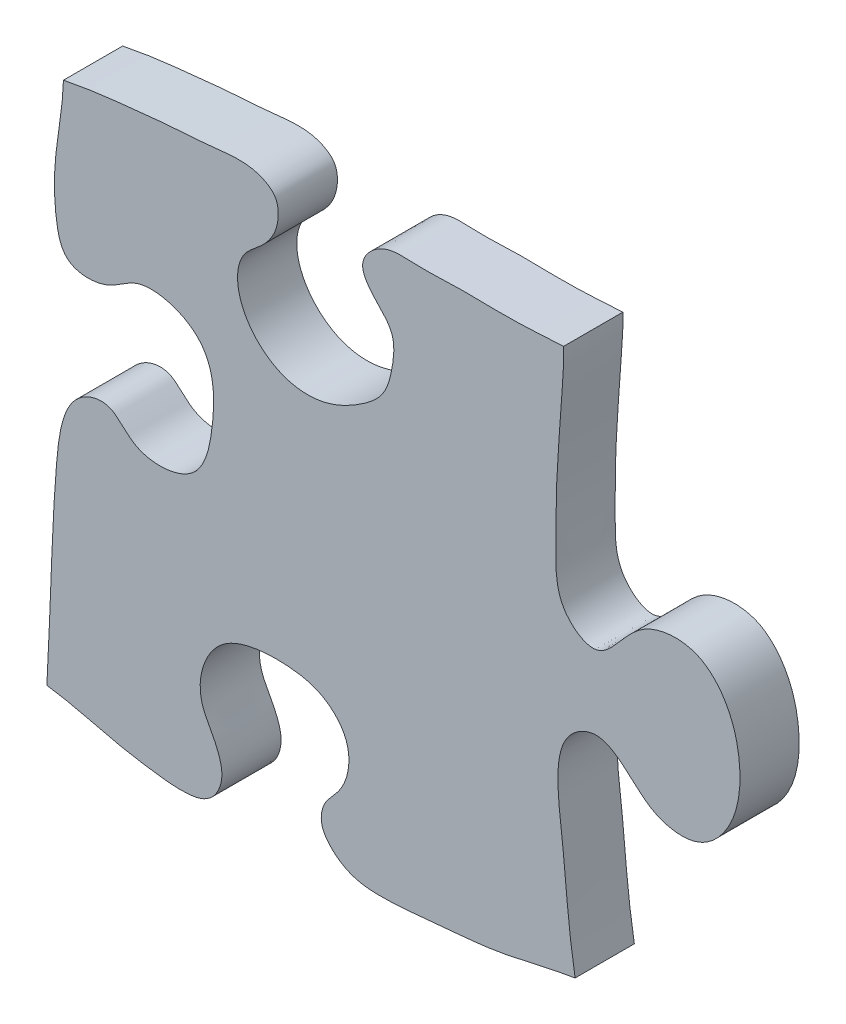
ISO-10303-21;
HEADER;
FILE_DESCRIPTION(('STEP AP214'),'2;1');
FILE_NAME('part.step','',(''),(''),'','','');
FILE_SCHEMA(('AUTOMOTIVE_DESIGN { 1 0 10303 214 1 1 1 1 }'));
ENDSEC;
DATA;
#1=APPLICATION_CONTEXT('core data for automotive mechanical design processes');
#2=APPLICATION_PROTOCOL_DEFINITION('international standard','automotive_design',2000,#1);
#3=PRODUCT_CONTEXT('',#1,'mechanical');
#4=PRODUCT('Part','Part','',(#3));
#5=PRODUCT_RELATED_PRODUCT_CATEGORY('part','',(#4));
#6=PRODUCT_DEFINITION_FORMATION('','',#4);
#7=PRODUCT_DEFINITION_CONTEXT('part definition',#1,'design');
#8=PRODUCT_DEFINITION('design','',#6,#7);
#9=PRODUCT_DEFINITION_SHAPE('','',#8);
#10=(LENGTH_UNIT() NAMED_UNIT(*) SI_UNIT(.MILLI.,.METRE.));
#11=(NAMED_UNIT(*) PLANE_ANGLE_UNIT() SI_UNIT($,.RADIAN.));
#12=(NAMED_UNIT(*) SI_UNIT($,.STERADIAN.) SOLID_ANGLE_UNIT());
#13=UNCERTAINTY_MEASURE_WITH_UNIT(LENGTH_MEASURE(1.E-05),#10,'distance_accuracy_value','');
#14=(GEOMETRIC_REPRESENTATION_CONTEXT(3) GLOBAL_UNCERTAINTY_ASSIGNED_CONTEXT((#13)) GLOBAL_UNIT_ASSIGNED_CONTEXT((#10,
#11,#12)) REPRESENTATION_CONTEXT('',''));
#15=CARTESIAN_POINT('',(0.,0.,0.));
#16=DIRECTION('',(0.,0.,1.));
#17=DIRECTION('',(1.,0.,0.));
#18=AXIS2_PLACEMENT_3D('',#15,#16,#17);
#19=CARTESIAN_POINT('',(-9.39078729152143,356.,-0.00999999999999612));
#20=CARTESIAN_POINT('',(-10.6420004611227,342.109118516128,-0.00999999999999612));
#21=CARTESIAN_POINT('',(-14.6613121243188,319.56927935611,-0.00999999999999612));
#22=CARTESIAN_POINT('',(-17.4473947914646,293.08555207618,-0.00999999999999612));
#23=CARTESIAN_POINT('',(-13.8884373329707,273.667988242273,-0.00999999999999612));
#24=CARTESIAN_POINT('',(-1.07625820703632,271.397705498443,-0.00999999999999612));
#25=CARTESIAN_POINT('',(5.29309239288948,278.450722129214,-0.00999999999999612));
#26=CARTESIAN_POINT('',(14.9258759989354,283.741247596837,-0.00999999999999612));
#27=CARTESIAN_POINT('',(28.790892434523,278.335723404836,-0.00999999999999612));
#28=CARTESIAN_POINT('',(34.7382562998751,261.206713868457,-0.00999999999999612));
#29=CARTESIAN_POINT('',(33.1132905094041,240.122633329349,-0.00999999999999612));
#30=CARTESIAN_POINT('',(14.6676977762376,229.968331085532,-0.00999999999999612));
#31=CARTESIAN_POINT('',(3.42611827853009,235.442407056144,-0.00999999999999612));
#32=CARTESIAN_POINT('',(-2.96249564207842,240.393740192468,-0.00999999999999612));
#33=CARTESIAN_POINT('',(-18.0780076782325,240.138784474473,-0.00999999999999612));
#34=CARTESIAN_POINT('',(-18.5399667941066,222.992463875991,-0.00999999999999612));
#35=CARTESIAN_POINT('',(-17.4385931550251,202.827665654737,-0.00999999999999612));
#36=CARTESIAN_POINT('',(-14.0858554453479,190.221137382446,-0.00999999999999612));
#37=CARTESIAN_POINT('',(-15.5193743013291,175.136568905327,-0.00999999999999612));
#38=CARTESIAN_POINT('',(-16.6888175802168,157.648124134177,-0.00999999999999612));
#39=CARTESIAN_POINT('',(-17.7707660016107,144.240131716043,-0.00999999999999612));
#40=CARTESIAN_POINT('',(-17.3940925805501,124.109890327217,-0.00999999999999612));
#41=CARTESIAN_POINT('',(-18.6861496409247,110.985540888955,-0.00999999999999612));
#42=CARTESIAN_POINT('',(-3.94695866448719,101.126063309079,-0.00999999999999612));
#43=CARTESIAN_POINT('',(4.50824278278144,111.148466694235,-0.00999999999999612));
#44=CARTESIAN_POINT('',(13.1578407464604,120.870763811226,-0.00999999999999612));
#45=CARTESIAN_POINT('',(29.968112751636,122.314288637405,-0.00999999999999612));
#46=CARTESIAN_POINT('',(40.7223803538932,110.783826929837,-0.00999999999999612));
#47=CARTESIAN_POINT('',(45.7909417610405,94.3968136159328,-0.00999999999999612));
#48=CARTESIAN_POINT('',(43.9390810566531,75.8787758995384,-0.00999999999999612));
#49=CARTESIAN_POINT('',(30.503103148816,62.5847389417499,-0.00999999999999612));
#50=CARTESIAN_POINT('',(14.6986660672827,64.8647821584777,-0.00999999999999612));
#51=CARTESIAN_POINT('',(6.48631275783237,74.2887035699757,-0.00999999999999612));
#52=CARTESIAN_POINT('',(-2.74495882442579,80.3019272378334,-0.00999999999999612));
#53=CARTESIAN_POINT('',(-19.8840521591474,73.8019115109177,-0.00999999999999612));
#54=CARTESIAN_POINT('',(-15.1166354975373,44.269693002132,-0.00999999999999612));
#55=CARTESIAN_POINT('',(-13.5094217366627,17.7920418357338,-0.00999999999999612));
#56=CARTESIAN_POINT('',(-10.2430798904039,-1.06342782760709,-0.00999999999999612));
#57=CARTESIAN_POINT('',(-6.15123504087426,-23.5391381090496,-0.00999999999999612));
#58=CARTESIAN_POINT('',(-4.12992604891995,-48.8436757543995,-0.00999999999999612));
#59=CARTESIAN_POINT('',(-23.2142462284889,-47.7574601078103,-0.00999999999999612));
#60=CARTESIAN_POINT('',(-30.0018234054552,-40.5423137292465,-0.00999999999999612));
#61=CARTESIAN_POINT('',(-42.7528213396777,-39.1853410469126,-0.00999999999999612));
#62=CARTESIAN_POINT('',(-57.5092962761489,-47.8418744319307,-0.00999999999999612));
#63=CARTESIAN_POINT('',(-60.2210733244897,-67.5138769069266,-0.00999999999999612));
#64=CARTESIAN_POINT('',(-54.0018378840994,-88.1567638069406,-0.00999999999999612));
#65=CARTESIAN_POINT('',(-33.5101255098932,-90.2818581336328,-0.00999999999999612));
#66=CARTESIAN_POINT('',(-26.938266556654,-78.8436195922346,-0.00999999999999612));
#67=CARTESIAN_POINT('',(-16.0575989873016,-79.9605650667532,-0.00999999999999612));
#68=CARTESIAN_POINT('',(-9.29054500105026,-89.9843542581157,-0.00999999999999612));
#69=CARTESIAN_POINT('',(-9.26037942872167,-106.547726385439,-0.00999999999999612));
#70=CARTESIAN_POINT('',(-10.8655976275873,-129.908253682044,-0.00999999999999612));
#71=CARTESIAN_POINT('',(-18.080355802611,-155.05589418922,-0.00999999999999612));
#72=CARTESIAN_POINT('',(-15.5015350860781,-180.564325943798,-0.00999999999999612));
#73=CARTESIAN_POINT('',(-13.4534563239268,-202.72625863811,-0.00999999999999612));
#74=CARTESIAN_POINT('',(-13.0721771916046,-222.761537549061,-0.00999999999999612));
#75=CARTESIAN_POINT('',(-18.0801009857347,-237.162246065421,-0.00999999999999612));
#76=CARTESIAN_POINT('',(-28.3640065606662,-243.264641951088,-0.00999999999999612));
#77=CARTESIAN_POINT('',(-35.3195309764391,-234.565632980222,-0.00999999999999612));
#78=CARTESIAN_POINT('',(-45.5220607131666,-230.442721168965,-0.00999999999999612));
#79=CARTESIAN_POINT('',(-58.2826152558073,-236.227844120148,-0.00999999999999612));
#80=CARTESIAN_POINT('',(-63.2505187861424,-252.690663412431,-0.00999999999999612));
#81=CARTESIAN_POINT('',(-62.4331763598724,-269.758175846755,-0.00999999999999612));
#82=CARTESIAN_POINT('',(-51.5712190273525,-281.475483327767,-0.00999999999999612));
#83=CARTESIAN_POINT('',(-36.6120763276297,-283.519302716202,-0.00999999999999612));
#84=CARTESIAN_POINT('',(-27.825780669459,-270.933950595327,-0.00999999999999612));
#85=CARTESIAN_POINT('',(-10.9923291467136,-277.705324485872,-0.00999999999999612));
#86=CARTESIAN_POINT('',(-14.9884890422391,-312.557066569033,-0.00999999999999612));
#87=CARTESIAN_POINT('',(-14.8626828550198,-333.640060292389,-0.00999999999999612));
#88=CARTESIAN_POINT('',(-17.0261941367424,-356.,-0.00999999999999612));
#89=B_SPLINE_CURVE_WITH_KNOTS('',3,(#19,#20,#21,#22,#23,#24,#25,#26,#27,#28,#29,#30,#31,#32,#33,
#34,#35,#36,#37,#38,#39,#40,#41,#42,#43,#44,#45,#46,#47,#48,#49,#50,#51,#52,#53,#54,#55,#56,#57,
#58,#59,#60,#61,#62,#63,#64,#65,#66,#67,#68,#69,#70,#71,#72,#73,#74,#75,#76,#77,#78,#79,#80,#81,
#82,#83,#84,#85,#86,#87,#88),.UNSPECIFIED.,.F.,.F.,(4,1,1,1,1,1,1,1,1,1,1,1,1,1,1,1,1,1,1,1,1,1,
1,1,1,1,1,1,1,1,1,1,1,1,1,1,1,1,1,1,1,1,1,1,1,1,1,1,1,1,1,1,1,1,1,1,1,1,1,1,1,1,1,1,1,1,1,4),
(0.,0.0382435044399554,0.06014267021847,0.0759154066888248,0.0830880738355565,
0.0898528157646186,0.100420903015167,0.110971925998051,0.125303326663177,0.146622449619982,
0.16313068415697,0.171984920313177,0.178976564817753,0.184846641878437,0.208558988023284,
0.213294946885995,0.232206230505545,0.247690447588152,0.25282597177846,0.280146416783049,
0.285652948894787,0.304476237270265,0.313783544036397,0.32377706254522,0.334253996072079,
0.350240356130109,0.361652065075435,0.37428972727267,0.396319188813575,0.408299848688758,
0.421251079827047,0.43387737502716,0.442611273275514,0.448402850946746,0.478919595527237,
0.50340807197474,0.525599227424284,0.531488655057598,0.562302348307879,0.569309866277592,
0.576593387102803,0.588291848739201,0.600948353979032,0.618957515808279,0.638096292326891,
0.652011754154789,0.663601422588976,0.667955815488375,0.679319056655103,0.692000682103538,
0.712742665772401,0.742765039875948,0.761777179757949,0.781638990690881,0.803327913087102,
0.815753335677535,0.82139602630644,0.831491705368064,0.840302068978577,0.85029925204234,
0.865053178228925,0.884091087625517,0.893653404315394,0.906570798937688,0.918850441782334,
0.928550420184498,0.945628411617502,1.),.UNSPECIFIED.);
#90=DIRECTION('',(0.,0.,1.));
#91=VECTOR('',#90,1.);
#92=SURFACE_OF_LINEAR_EXTRUSION('',#89,#91);
#93=CARTESIAN_POINT('',(-9.39078729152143,356.,20.));
#94=CARTESIAN_POINT('',(-10.6420004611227,342.109118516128,20.));
#95=CARTESIAN_POINT('',(-14.6613121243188,319.56927935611,20.));
#96=CARTESIAN_POINT('',(-17.4473947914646,293.08555207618,20.));
#97=CARTESIAN_POINT('',(-13.8884373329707,273.667988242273,20.));
#98=CARTESIAN_POINT('',(-1.07625820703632,271.397705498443,20.));
#99=CARTESIAN_POINT('',(5.29309239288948,278.450722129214,20.));
#100=CARTESIAN_POINT('',(14.9258759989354,283.741247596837,20.));
#101=CARTESIAN_POINT('',(28.790892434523,278.335723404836,20.));
#102=CARTESIAN_POINT('',(34.7382562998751,261.206713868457,20.));
#103=CARTESIAN_POINT('',(33.1132905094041,240.122633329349,20.));
#104=CARTESIAN_POINT('',(14.6676977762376,229.968331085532,20.));
#105=CARTESIAN_POINT('',(3.42611827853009,235.442407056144,20.));
#106=CARTESIAN_POINT('',(-2.96249564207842,240.393740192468,20.));
#107=CARTESIAN_POINT('',(-18.0780076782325,240.138784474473,20.));
#108=CARTESIAN_POINT('',(-18.5399667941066,222.992463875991,20.));
#109=CARTESIAN_POINT('',(-17.4385931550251,202.827665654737,20.));
#110=CARTESIAN_POINT('',(-14.0858554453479,190.221137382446,20.));
#111=CARTESIAN_POINT('',(-15.5193743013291,175.136568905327,20.));
#112=CARTESIAN_POINT('',(-16.6888175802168,157.648124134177,20.));
#113=CARTESIAN_POINT('',(-17.7707660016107,144.240131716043,20.));
#114=CARTESIAN_POINT('',(-17.3940925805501,124.109890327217,20.));
#115=CARTESIAN_POINT('',(-18.6861496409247,110.985540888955,20.));
#116=CARTESIAN_POINT('',(-3.94695866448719,101.126063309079,20.));
#117=CARTESIAN_POINT('',(4.50824278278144,111.148466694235,20.));
#118=CARTESIAN_POINT('',(13.1578407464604,120.870763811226,20.));
#119=CARTESIAN_POINT('',(29.968112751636,122.314288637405,20.));
#120=CARTESIAN_POINT('',(40.7223803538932,110.783826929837,20.));
#121=CARTESIAN_POINT('',(45.7909417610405,94.3968136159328,20.));
#122=CARTESIAN_POINT('',(43.9390810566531,75.8787758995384,20.));
#123=CARTESIAN_POINT('',(30.503103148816,62.5847389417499,20.));
#124=CARTESIAN_POINT('',(14.6986660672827,64.8647821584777,20.));
#125=CARTESIAN_POINT('',(6.48631275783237,74.2887035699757,20.));
#126=CARTESIAN_POINT('',(-2.74495882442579,80.3019272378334,20.));
#127=CARTESIAN_POINT('',(-19.8840521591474,73.8019115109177,20.));
#128=CARTESIAN_POINT('',(-15.1166354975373,44.269693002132,20.));
#129=CARTESIAN_POINT('',(-13.5094217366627,17.7920418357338,20.));
#130=CARTESIAN_POINT('',(-10.2430798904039,-1.06342782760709,20.));
#131=CARTESIAN_POINT('',(-6.15123504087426,-23.5391381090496,20.));
#132=CARTESIAN_POINT('',(-4.12992604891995,-48.8436757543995,20.));
#133=CARTESIAN_POINT('',(-23.2142462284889,-47.7574601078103,20.));
#134=CARTESIAN_POINT('',(-30.0018234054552,-40.5423137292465,20.));
#135=CARTESIAN_POINT('',(-42.7528213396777,-39.1853410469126,20.));
#136=CARTESIAN_POINT('',(-57.5092962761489,-47.8418744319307,20.));
#137=CARTESIAN_POINT('',(-60.2210733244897,-67.5138769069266,20.));
#138=CARTESIAN_POINT('',(-54.0018378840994,-88.1567638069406,20.));
#139=CARTESIAN_POINT('',(-33.5101255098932,-90.2818581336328,20.));
#140=CARTESIAN_POINT('',(-26.938266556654,-78.8436195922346,20.));
#141=CARTESIAN_POINT('',(-16.0575989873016,-79.9605650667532,20.));
#142=CARTESIAN_POINT('',(-9.29054500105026,-89.9843542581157,20.));
#143=CARTESIAN_POINT('',(-9.26037942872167,-106.547726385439,20.));
#144=CARTESIAN_POINT('',(-10.8655976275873,-129.908253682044,20.));
#145=CARTESIAN_POINT('',(-18.080355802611,-155.05589418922,20.));
#146=CARTESIAN_POINT('',(-15.5015350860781,-180.564325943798,20.));
#147=CARTESIAN_POINT('',(-13.4534563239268,-202.72625863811,20.));
#148=CARTESIAN_POINT('',(-13.0721771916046,-222.761537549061,20.));
#149=CARTESIAN_POINT('',(-18.0801009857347,-237.162246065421,20.));
#150=CARTESIAN_POINT('',(-28.3640065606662,-243.264641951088,20.));
#151=CARTESIAN_POINT('',(-35.3195309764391,-234.565632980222,20.));
#152=CARTESIAN_POINT('',(-45.5220607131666,-230.442721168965,20.));
#153=CARTESIAN_POINT('',(-58.2826152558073,-236.227844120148,20.));
#154=CARTESIAN_POINT('',(-63.2505187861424,-252.690663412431,20.));
#155=CARTESIAN_POINT('',(-62.4331763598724,-269.758175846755,20.));
#156=CARTESIAN_POINT('',(-51.5712190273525,-281.475483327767,20.));
#157=CARTESIAN_POINT('',(-36.6120763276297,-283.519302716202,20.));
#158=CARTESIAN_POINT('',(-27.825780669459,-270.933950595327,20.));
#159=CARTESIAN_POINT('',(-10.9923291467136,-277.705324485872,20.));
#160=CARTESIAN_POINT('',(-14.9884890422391,-312.557066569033,20.));
#161=CARTESIAN_POINT('',(-14.8626828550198,-333.640060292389,20.));
#162=CARTESIAN_POINT('',(-17.0261941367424,-356.,20.));
#163=B_SPLINE_CURVE_WITH_KNOTS('',3,(#93,#94,#95,#96,#97,#98,#99,#100,#101,#102,#103,#104,#105,
#106,#107,#108,#109,#110,#111,#112,#113,#114,#115,#116,#117,#118,#119,#120,#121,#122,#123,#124,
#125,#126,#127,#128,#129,#130,#131,#132,#133,#134,#135,#136,#137,#138,#139,#140,#141,#142,#143,
#144,#145,#146,#147,#148,#149,#150,#151,#152,#153,#154,#155,#156,#157,#158,#159,#160,#161,#162),
.UNSPECIFIED.,.F.,.F.,(4,1,1,1,1,1,1,1,1,1,1,1,1,1,1,1,1,1,1,1,1,1,1,1,1,1,1,1,1,1,1,1,1,1,1,1,
1,1,1,1,1,1,1,1,1,1,1,1,1,1,1,1,1,1,1,1,1,1,1,1,1,1,1,1,1,1,1,4),(0.,0.0382435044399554,
0.06014267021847,0.0759154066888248,0.0830880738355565,0.0898528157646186,0.100420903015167,
0.110971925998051,0.125303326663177,0.146622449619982,0.16313068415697,0.171984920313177,
0.178976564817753,0.184846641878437,0.208558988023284,0.213294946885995,0.232206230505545,
0.247690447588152,0.25282597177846,0.280146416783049,0.285652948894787,0.304476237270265,
0.313783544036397,0.32377706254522,0.334253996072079,0.350240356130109,0.361652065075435,
0.37428972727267,0.396319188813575,0.408299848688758,0.421251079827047,0.43387737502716,
0.442611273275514,0.448402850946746,0.478919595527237,0.50340807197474,0.525599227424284,
0.531488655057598,0.562302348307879,0.569309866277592,0.576593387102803,0.588291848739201,
0.600948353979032,0.618957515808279,0.638096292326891,0.652011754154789,0.663601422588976,
0.667955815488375,0.679319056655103,0.692000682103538,0.712742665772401,0.742765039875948,
0.761777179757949,0.781638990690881,0.803327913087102,0.815753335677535,0.82139602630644,
0.831491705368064,0.840302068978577,0.85029925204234,0.865053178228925,0.884091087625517,
0.893653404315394,0.906570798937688,0.918850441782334,0.928550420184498,0.945628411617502,1.),.UNSPECIFIED.);
#164=CARTESIAN_POINT('',(-15.0113557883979,187.32777425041,20.));
#165=VERTEX_POINT('',#164);
#166=CARTESIAN_POINT('',(-11.1415971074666,4.42864181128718,20.));
#167=VERTEX_POINT('',#166);
#168=EDGE_CURVE('E89',#165,#167,#163,.T.);
#169=ORIENTED_EDGE('',*,*,#168,.T.);
#170=DIRECTION('',(0.,0.,1.));
#171=VECTOR('',#170,1.);
#172=CARTESIAN_POINT('',(-11.1415971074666,4.42864181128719,-0.00999999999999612));
#173=LINE('',#172,#171);
#174=CARTESIAN_POINT('',(-11.1415971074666,4.42864181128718,0.));
#175=VERTEX_POINT('',#174);
#176=EDGE_CURVE('E79',#167,#175,#173,.F.);
#177=ORIENTED_EDGE('',*,*,#176,.T.);
#178=CARTESIAN_POINT('',(-9.39078729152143,356.,0.));
#179=CARTESIAN_POINT('',(-10.6420004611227,342.109118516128,0.));
#180=CARTESIAN_POINT('',(-14.6613121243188,319.56927935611,0.));
#181=CARTESIAN_POINT('',(-17.4473947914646,293.08555207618,0.));
#182=CARTESIAN_POINT('',(-13.8884373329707,273.667988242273,0.));
#183=CARTESIAN_POINT('',(-1.07625820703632,271.397705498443,0.));
#184=CARTESIAN_POINT('',(5.29309239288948,278.450722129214,0.));
#185=CARTESIAN_POINT('',(14.9258759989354,283.741247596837,0.));
#186=CARTESIAN_POINT('',(28.790892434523,278.335723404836,0.));
#187=CARTESIAN_POINT('',(34.7382562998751,261.206713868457,0.));
#188=CARTESIAN_POINT('',(33.1132905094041,240.122633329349,0.));
#189=CARTESIAN_POINT('',(14.6676977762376,229.968331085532,0.));
#190=CARTESIAN_POINT('',(3.42611827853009,235.442407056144,0.));
#191=CARTESIAN_POINT('',(-2.96249564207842,240.393740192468,0.));
#192=CARTESIAN_POINT('',(-18.0780076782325,240.138784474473,0.));
#193=CARTESIAN_POINT('',(-18.5399667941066,222.992463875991,0.));
#194=CARTESIAN_POINT('',(-17.4385931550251,202.827665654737,0.));
#195=CARTESIAN_POINT('',(-14.0858554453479,190.221137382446,0.));
#196=CARTESIAN_POINT('',(-15.5193743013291,175.136568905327,0.));
#197=CARTESIAN_POINT('',(-16.6888175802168,157.648124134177,0.));
#198=CARTESIAN_POINT('',(-17.7707660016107,144.240131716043,0.));
#199=CARTESIAN_POINT('',(-17.3940925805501,124.109890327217,0.));
#200=CARTESIAN_POINT('',(-18.6861496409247,110.985540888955,0.));
#201=CARTESIAN_POINT('',(-3.94695866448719,101.126063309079,0.));
#202=CARTESIAN_POINT('',(4.50824278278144,111.148466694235,0.));
#203=CARTESIAN_POINT('',(13.1578407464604,120.870763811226,0.));
#204=CARTESIAN_POINT('',(29.968112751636,122.314288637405,0.));
#205=CARTESIAN_POINT('',(40.7223803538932,110.783826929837,0.));
#206=CARTESIAN_POINT('',(45.7909417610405,94.3968136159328,0.));
#207=CARTESIAN_POINT('',(43.9390810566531,75.8787758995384,0.));
#208=CARTESIAN_POINT('',(30.503103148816,62.5847389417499,0.));
#209=CARTESIAN_POINT('',(14.6986660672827,64.8647821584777,0.));
#210=CARTESIAN_POINT('',(6.48631275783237,74.2887035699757,0.));
#211=CARTESIAN_POINT('',(-2.74495882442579,80.3019272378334,0.));
#212=CARTESIAN_POINT('',(-19.8840521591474,73.8019115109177,0.));
#213=CARTESIAN_POINT('',(-15.1166354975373,44.269693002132,0.));
#214=CARTESIAN_POINT('',(-13.5094217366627,17.7920418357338,0.));
#215=CARTESIAN_POINT('',(-10.2430798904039,-1.06342782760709,0.));
#216=CARTESIAN_POINT('',(-6.15123504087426,-23.5391381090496,0.));
#217=CARTESIAN_POINT('',(-4.12992604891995,-48.8436757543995,0.));
#218=CARTESIAN_POINT('',(-23.2142462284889,-47.7574601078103,0.));
#219=CARTESIAN_POINT('',(-30.0018234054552,-40.5423137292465,0.));
#220=CARTESIAN_POINT('',(-42.7528213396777,-39.1853410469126,0.));
#221=CARTESIAN_POINT('',(-57.5092962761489,-47.8418744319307,0.));
#222=CARTESIAN_POINT('',(-60.2210733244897,-67.5138769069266,0.));
#223=CARTESIAN_POINT('',(-54.0018378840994,-88.1567638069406,0.));
#224=CARTESIAN_POINT('',(-33.5101255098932,-90.2818581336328,0.));
#225=CARTESIAN_POINT('',(-26.938266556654,-78.8436195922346,0.));
#226=CARTESIAN_POINT('',(-16.0575989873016,-79.9605650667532,0.));
#227=CARTESIAN_POINT('',(-9.29054500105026,-89.9843542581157,0.));
#228=CARTESIAN_POINT('',(-9.26037942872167,-106.547726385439,0.));
#229=CARTESIAN_POINT('',(-10.8655976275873,-129.908253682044,0.));
#230=CARTESIAN_POINT('',(-18.080355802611,-155.05589418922,0.));
#231=CARTESIAN_POINT('',(-15.5015350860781,-180.564325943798,0.));
#232=CARTESIAN_POINT('',(-13.4534563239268,-202.72625863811,0.));
#233=CARTESIAN_POINT('',(-13.0721771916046,-222.761537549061,0.));
#234=CARTESIAN_POINT('',(-18.0801009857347,-237.162246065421,0.));
#235=CARTESIAN_POINT('',(-28.3640065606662,-243.264641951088,0.));
#236=CARTESIAN_POINT('',(-35.3195309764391,-234.565632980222,0.));
#237=CARTESIAN_POINT('',(-45.5220607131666,-230.442721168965,0.));
#238=CARTESIAN_POINT('',(-58.2826152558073,-236.227844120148,0.));
#239=CARTESIAN_POINT('',(-63.2505187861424,-252.690663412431,0.));
#240=CARTESIAN_POINT('',(-62.4331763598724,-269.758175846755,0.));
#241=CARTESIAN_POINT('',(-51.5712190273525,-281.475483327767,0.));
#242=CARTESIAN_POINT('',(-36.6120763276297,-283.519302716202,0.));
#243=CARTESIAN_POINT('',(-27.825780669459,-270.933950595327,0.));
#244=CARTESIAN_POINT('',(-10.9923291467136,-277.705324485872,0.));
#245=CARTESIAN_POINT('',(-14.9884890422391,-312.557066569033,0.));
#246=CARTESIAN_POINT('',(-14.8626828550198,-333.640060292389,0.));
#247=CARTESIAN_POINT('',(-17.0261941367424,-356.,0.));
#248=B_SPLINE_CURVE_WITH_KNOTS('',3,(#178,#179,#180,#181,#182,#183,#184,#185,#186,#187,#188,
#189,#190,#191,#192,#193,#194,#195,#196,#197,#198,#199,#200,#201,#202,#203,#204,#205,#206,#207,
#208,#209,#210,#211,#212,#213,#214,#215,#216,#217,#218,#219,#220,#221,#222,#223,#224,#225,#226,
#227,#228,#229,#230,#231,#232,#233,#234,#235,#236,#237,#238,#239,#240,#241,#242,#243,#244,#245,
#246,#247),.UNSPECIFIED.,.F.,.F.,(4,1,1,1,1,1,1,1,1,1,1,1,1,1,1,1,1,1,1,1,1,1,1,1,1,1,1,1,1,1,1,
1,1,1,1,1,1,1,1,1,1,1,1,1,1,1,1,1,1,1,1,1,1,1,1,1,1,1,1,1,1,1,1,1,1,1,1,4),(0.,
0.0382435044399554,0.06014267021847,0.0759154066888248,0.0830880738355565,0.0898528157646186,
0.100420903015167,0.110971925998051,0.125303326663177,0.146622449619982,0.16313068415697,
0.171984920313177,0.178976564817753,0.184846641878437,0.208558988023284,0.213294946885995,
0.232206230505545,0.247690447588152,0.25282597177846,0.280146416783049,0.285652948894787,
0.304476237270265,0.313783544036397,0.32377706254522,0.334253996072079,0.350240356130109,
0.361652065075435,0.37428972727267,0.396319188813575,0.408299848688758,0.421251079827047,
0.43387737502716,0.442611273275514,0.448402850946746,0.478919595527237,0.50340807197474,
0.525599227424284,0.531488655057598,0.562302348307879,0.569309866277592,0.576593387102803,
0.588291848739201,0.600948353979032,0.618957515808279,0.638096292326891,0.652011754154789,
0.663601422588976,0.667955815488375,0.679319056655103,0.692000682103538,0.712742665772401,
0.742765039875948,0.761777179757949,0.781638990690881,0.803327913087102,0.815753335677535,
0.82139602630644,0.831491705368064,0.840302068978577,0.85029925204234,0.865053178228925,
0.884091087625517,0.893653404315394,0.906570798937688,0.918850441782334,0.928550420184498,
0.945628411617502,1.),.UNSPECIFIED.);
#249=CARTESIAN_POINT('',(-15.0113557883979,187.32777425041,0.));
#250=VERTEX_POINT('',#249);
#251=EDGE_CURVE('E116',#250,#175,#248,.T.);
#252=ORIENTED_EDGE('',*,*,#251,.F.);
#253=DIRECTION('',(0.,0.,1.));
#254=VECTOR('',#253,1.);
#255=CARTESIAN_POINT('',(-15.0113557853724,187.327774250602,-0.00999999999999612));
#256=LINE('',#255,#254);
#257=EDGE_CURVE('E90',#165,#250,#256,.F.);
#258=ORIENTED_EDGE('',*,*,#257,.F.);
#259=EDGE_LOOP('',(#169,#177,#252,#258));
#260=FACE_BOUND('',#259,.T.);
#261=ADVANCED_FACE('F34',(#260),#92,.F.);
#262=CARTESIAN_POINT('',(-186.393246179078,356.,-0.00999999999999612));
#263=CARTESIAN_POINT('',(-186.465644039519,346.788250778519,-0.00999999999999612));
#264=CARTESIAN_POINT('',(-188.628884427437,329.478394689,-0.00999999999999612));
#265=CARTESIAN_POINT('',(-190.429976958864,304.816732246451,-0.00999999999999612));
#266=CARTESIAN_POINT('',(-187.884620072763,287.022607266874,-0.00999999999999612));
#267=CARTESIAN_POINT('',(-177.83183487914,273.701157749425,-0.00999999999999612));
#268=CARTESIAN_POINT('',(-167.372440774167,281.069990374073,-0.00999999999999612));
#269=CARTESIAN_POINT('',(-162.424812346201,293.671302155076,-0.00999999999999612));
#270=CARTESIAN_POINT('',(-138.980403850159,295.954762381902,-0.00999999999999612));
#271=CARTESIAN_POINT('',(-129.023505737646,274.502332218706,-0.00999999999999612));
#272=CARTESIAN_POINT('',(-130.151753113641,256.130310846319,-0.00999999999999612));
#273=CARTESIAN_POINT('',(-138.180313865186,240.882815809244,-0.00999999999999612));
#274=CARTESIAN_POINT('',(-153.903325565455,237.974697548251,-0.00999999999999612));
#275=CARTESIAN_POINT('',(-162.781582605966,247.270783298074,-0.00999999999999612));
#276=CARTESIAN_POINT('',(-171.61954140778,254.983724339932,-0.00999999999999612));
#277=CARTESIAN_POINT('',(-186.267660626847,251.663377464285,-0.00999999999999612));
#278=CARTESIAN_POINT('',(-188.178219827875,226.271427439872,-0.00999999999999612));
#279=CARTESIAN_POINT('',(-186.828985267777,214.10322906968,-0.00999999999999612));
#280=CARTESIAN_POINT('',(-182.631402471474,181.666904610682,-0.00999999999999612));
#281=CARTESIAN_POINT('',(-187.119801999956,157.75465666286,-0.00999999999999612));
#282=CARTESIAN_POINT('',(-187.457937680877,142.904539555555,-0.00999999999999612));
#283=CARTESIAN_POINT('',(-184.089404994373,126.204275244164,-0.00999999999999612));
#284=CARTESIAN_POINT('',(-168.499206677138,126.488047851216,-0.00999999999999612));
#285=CARTESIAN_POINT('',(-158.423592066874,136.759079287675,-0.00999999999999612));
#286=CARTESIAN_POINT('',(-133.598254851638,130.460350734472,-0.00999999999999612));
#287=CARTESIAN_POINT('',(-132.174041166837,109.25711139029,-0.00999999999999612));
#288=CARTESIAN_POINT('',(-137.401430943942,84.0677449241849,-0.00999999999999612));
#289=CARTESIAN_POINT('',(-159.905312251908,82.8448138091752,-0.00999999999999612));
#290=CARTESIAN_POINT('',(-167.594499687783,95.2630828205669,-0.00999999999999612));
#291=CARTESIAN_POINT('',(-184.064608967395,90.371493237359,-0.00999999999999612));
#292=CARTESIAN_POINT('',(-186.999172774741,63.1173196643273,-0.00999999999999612));
#293=CARTESIAN_POINT('',(-188.17555036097,34.3474510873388,-0.00999999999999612));
#294=CARTESIAN_POINT('',(-189.520016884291,-1.94344937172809,-0.00999999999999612));
#295=CARTESIAN_POINT('',(-192.230906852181,-38.9111914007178,-0.00999999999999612));
#296=CARTESIAN_POINT('',(-193.196462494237,-56.4819013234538,-0.00999999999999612));
#297=CARTESIAN_POINT('',(-187.787083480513,-81.0819408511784,-0.00999999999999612));
#298=CARTESIAN_POINT('',(-174.027975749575,-78.613025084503,-0.00999999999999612));
#299=CARTESIAN_POINT('',(-167.64120428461,-66.7586676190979,-0.00999999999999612));
#300=CARTESIAN_POINT('',(-138.878579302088,-69.8200733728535,-0.00999999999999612));
#301=CARTESIAN_POINT('',(-138.315063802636,-94.39593724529,-0.00999999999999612));
#302=CARTESIAN_POINT('',(-145.951566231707,-114.49908529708,-0.00999999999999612));
#303=CARTESIAN_POINT('',(-163.555921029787,-121.175747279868,-0.00999999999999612));
#304=CARTESIAN_POINT('',(-172.11578880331,-114.919909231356,-0.00999999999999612));
#305=CARTESIAN_POINT('',(-176.485425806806,-107.364168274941,-0.00999999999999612));
#306=CARTESIAN_POINT('',(-184.309097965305,-107.607264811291,-0.00999999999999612));
#307=CARTESIAN_POINT('',(-188.561946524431,-116.100575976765,-0.00999999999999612));
#308=CARTESIAN_POINT('',(-189.834439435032,-132.751458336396,-0.00999999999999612));
#309=CARTESIAN_POINT('',(-188.899668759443,-143.69775261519,-0.00999999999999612));
#310=CARTESIAN_POINT('',(-186.87437190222,-176.639875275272,-0.00999999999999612));
#311=CARTESIAN_POINT('',(-187.115886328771,-188.95785352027,-0.00999999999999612));
#312=CARTESIAN_POINT('',(-184.068917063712,-208.490912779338,-0.00999999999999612));
#313=CARTESIAN_POINT('',(-184.462371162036,-228.434350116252,-0.00999999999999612));
#314=CARTESIAN_POINT('',(-182.717405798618,-241.744671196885,-0.00999999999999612));
#315=CARTESIAN_POINT('',(-190.107123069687,-258.646375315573,-0.00999999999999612));
#316=CARTESIAN_POINT('',(-204.50360377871,-253.849993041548,-0.00999999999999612));
#317=CARTESIAN_POINT('',(-211.768269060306,-241.698033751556,-0.00999999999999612));
#318=CARTESIAN_POINT('',(-230.141572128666,-243.165284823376,-0.00999999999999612));
#319=CARTESIAN_POINT('',(-238.864067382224,-259.702852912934,-0.00999999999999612));
#320=CARTESIAN_POINT('',(-237.82033634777,-276.944530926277,-0.00999999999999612));
#321=CARTESIAN_POINT('',(-229.688332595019,-293.402921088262,-0.00999999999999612));
#322=CARTESIAN_POINT('',(-210.804716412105,-298.51720908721,-0.00999999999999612));
#323=CARTESIAN_POINT('',(-204.725260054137,-287.600226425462,-0.00999999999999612));
#324=CARTESIAN_POINT('',(-198.130842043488,-278.388409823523,-0.00999999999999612));
#325=CARTESIAN_POINT('',(-189.724281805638,-288.428094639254,-0.00999999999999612));
#326=CARTESIAN_POINT('',(-185.110914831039,-304.121783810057,-0.00999999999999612));
#327=CARTESIAN_POINT('',(-188.504639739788,-328.326605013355,-0.00999999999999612));
#328=CARTESIAN_POINT('',(-188.031330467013,-347.655914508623,-0.00999999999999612));
#329=CARTESIAN_POINT('',(-188.197680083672,-356.,-0.00999999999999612));
#330=B_SPLINE_CURVE_WITH_KNOTS('',3,(#262,#263,#264,#265,#266,#267,#268,#269,#270,#271,#272,
#273,#274,#275,#276,#277,#278,#279,#280,#281,#282,#283,#284,#285,#286,#287,#288,#289,#290,#291,
#292,#293,#294,#295,#296,#297,#298,#299,#300,#301,#302,#303,#304,#305,#306,#307,#308,#309,#310,
#311,#312,#313,#314,#315,#316,#317,#318,#319,#320,#321,#322,#323,#324,#325,#326,#327,#328,#329),
.UNSPECIFIED.,.F.,.F.,(4,1,1,1,1,1,1,1,1,1,1,1,1,1,1,1,1,1,1,1,1,1,1,1,1,1,1,1,1,1,1,1,1,1,1,1,
1,1,1,1,1,1,1,1,1,1,1,1,1,1,1,1,1,1,1,1,1,1,1,1,1,1,1,1,1,4),(0.,0.0262331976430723,
0.050560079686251,0.0695219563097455,0.0800713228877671,0.0885051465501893,0.099482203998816,
0.118619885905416,0.138837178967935,0.157899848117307,0.171291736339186,0.185151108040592,
0.19559453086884,0.206745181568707,0.217337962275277,0.230877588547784,0.26409725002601,
0.28835141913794,0.305292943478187,0.32505690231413,0.334743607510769,0.348191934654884,
0.358741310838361,0.375812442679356,0.401272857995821,0.416827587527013,0.432882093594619,
0.444490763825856,0.458014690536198,0.481063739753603,0.510647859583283,0.548186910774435,
0.587648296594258,0.610908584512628,0.621783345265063,0.631931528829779,0.643591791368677,
0.658807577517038,0.686126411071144,0.703957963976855,0.718649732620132,0.731300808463,
0.735266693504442,0.736591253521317,0.743662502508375,0.746501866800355,0.76410099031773,
0.785041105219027,0.790214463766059,0.812987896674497,0.817887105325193,0.836359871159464,
0.84408330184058,0.853053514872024,0.86313504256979,0.875355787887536,0.885829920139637,
0.902341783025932,0.912788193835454,0.926625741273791,0.934943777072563,0.940543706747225,
0.946912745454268,0.957064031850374,0.980148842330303,1.),.UNSPECIFIED.);
#331=DIRECTION('',(0.,0.,1.));
#332=VECTOR('',#331,1.);
#333=SURFACE_OF_LINEAR_EXTRUSION('',#330,#332);
#334=CARTESIAN_POINT('',(-186.393246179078,356.,20.));
#335=CARTESIAN_POINT('',(-186.465644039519,346.788250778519,20.));
#336=CARTESIAN_POINT('',(-188.628884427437,329.478394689,20.));
#337=CARTESIAN_POINT('',(-190.429976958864,304.816732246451,20.));
#338=CARTESIAN_POINT('',(-187.884620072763,287.022607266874,20.));
#339=CARTESIAN_POINT('',(-177.83183487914,273.701157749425,20.));
#340=CARTESIAN_POINT('',(-167.372440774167,281.069990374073,20.));
#341=CARTESIAN_POINT('',(-162.424812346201,293.671302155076,20.));
#342=CARTESIAN_POINT('',(-138.980403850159,295.954762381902,20.));
#343=CARTESIAN_POINT('',(-129.023505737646,274.502332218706,20.));
#344=CARTESIAN_POINT('',(-130.151753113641,256.130310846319,20.));
#345=CARTESIAN_POINT('',(-138.180313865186,240.882815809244,20.));
#346=CARTESIAN_POINT('',(-153.903325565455,237.974697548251,20.));
#347=CARTESIAN_POINT('',(-162.781582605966,247.270783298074,20.));
#348=CARTESIAN_POINT('',(-171.61954140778,254.983724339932,20.));
#349=CARTESIAN_POINT('',(-186.267660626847,251.663377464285,20.));
#350=CARTESIAN_POINT('',(-188.178219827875,226.271427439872,20.));
#351=CARTESIAN_POINT('',(-186.828985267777,214.10322906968,20.));
#352=CARTESIAN_POINT('',(-182.631402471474,181.666904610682,20.));
#353=CARTESIAN_POINT('',(-187.119801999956,157.75465666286,20.));
#354=CARTESIAN_POINT('',(-187.457937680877,142.904539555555,20.));
#355=CARTESIAN_POINT('',(-184.089404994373,126.204275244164,20.));
#356=CARTESIAN_POINT('',(-168.499206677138,126.488047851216,20.));
#357=CARTESIAN_POINT('',(-158.423592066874,136.759079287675,20.));
#358=CARTESIAN_POINT('',(-133.598254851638,130.460350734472,20.));
#359=CARTESIAN_POINT('',(-132.174041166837,109.25711139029,20.));
#360=CARTESIAN_POINT('',(-137.401430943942,84.0677449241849,20.));
#361=CARTESIAN_POINT('',(-159.905312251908,82.8448138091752,20.));
#362=CARTESIAN_POINT('',(-167.594499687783,95.2630828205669,20.));
#363=CARTESIAN_POINT('',(-184.064608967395,90.371493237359,20.));
#364=CARTESIAN_POINT('',(-186.999172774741,63.1173196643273,20.));
#365=CARTESIAN_POINT('',(-188.17555036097,34.3474510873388,20.));
#366=CARTESIAN_POINT('',(-189.520016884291,-1.94344937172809,20.));
#367=CARTESIAN_POINT('',(-192.230906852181,-38.9111914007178,20.));
#368=CARTESIAN_POINT('',(-193.196462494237,-56.4819013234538,20.));
#369=CARTESIAN_POINT('',(-187.787083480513,-81.0819408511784,20.));
#370=CARTESIAN_POINT('',(-174.027975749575,-78.613025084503,20.));
#371=CARTESIAN_POINT('',(-167.64120428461,-66.7586676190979,20.));
#372=CARTESIAN_POINT('',(-138.878579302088,-69.8200733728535,20.));
#373=CARTESIAN_POINT('',(-138.315063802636,-94.39593724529,20.));
#374=CARTESIAN_POINT('',(-145.951566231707,-114.49908529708,20.));
#375=CARTESIAN_POINT('',(-163.555921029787,-121.175747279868,20.));
#376=CARTESIAN_POINT('',(-172.11578880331,-114.919909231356,20.));
#377=CARTESIAN_POINT('',(-176.485425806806,-107.364168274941,20.));
#378=CARTESIAN_POINT('',(-184.309097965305,-107.607264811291,20.));
#379=CARTESIAN_POINT('',(-188.561946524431,-116.100575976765,20.));
#380=CARTESIAN_POINT('',(-189.834439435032,-132.751458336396,20.));
#381=CARTESIAN_POINT('',(-188.899668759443,-143.69775261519,20.));
#382=CARTESIAN_POINT('',(-186.87437190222,-176.639875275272,20.));
#383=CARTESIAN_POINT('',(-187.115886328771,-188.95785352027,20.));
#384=CARTESIAN_POINT('',(-184.068917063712,-208.490912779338,20.));
#385=CARTESIAN_POINT('',(-184.462371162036,-228.434350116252,20.));
#386=CARTESIAN_POINT('',(-182.717405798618,-241.744671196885,20.));
#387=CARTESIAN_POINT('',(-190.107123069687,-258.646375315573,20.));
#388=CARTESIAN_POINT('',(-204.50360377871,-253.849993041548,20.));
#389=CARTESIAN_POINT('',(-211.768269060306,-241.698033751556,20.));
#390=CARTESIAN_POINT('',(-230.141572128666,-243.165284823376,20.));
#391=CARTESIAN_POINT('',(-238.864067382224,-259.702852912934,20.));
#392=CARTESIAN_POINT('',(-237.82033634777,-276.944530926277,20.));
#393=CARTESIAN_POINT('',(-229.688332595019,-293.402921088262,20.));
#394=CARTESIAN_POINT('',(-210.804716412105,-298.51720908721,20.));
#395=CARTESIAN_POINT('',(-204.725260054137,-287.600226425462,20.));
#396=CARTESIAN_POINT('',(-198.130842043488,-278.388409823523,20.));
#397=CARTESIAN_POINT('',(-189.724281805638,-288.428094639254,20.));
#398=CARTESIAN_POINT('',(-185.110914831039,-304.121783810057,20.));
#399=CARTESIAN_POINT('',(-188.504639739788,-328.326605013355,20.));
#400=CARTESIAN_POINT('',(-188.031330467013,-347.655914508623,20.));
#401=CARTESIAN_POINT('',(-188.197680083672,-356.,20.));
#402=B_SPLINE_CURVE_WITH_KNOTS('',3,(#334,#335,#336,#337,#338,#339,#340,#341,#342,#343,#344,
#345,#346,#347,#348,#349,#350,#351,#352,#353,#354,#355,#356,#357,#358,#359,#360,#361,#362,#363,
#364,#365,#366,#367,#368,#369,#370,#371,#372,#373,#374,#375,#376,#377,#378,#379,#380,#381,#382,
#383,#384,#385,#386,#387,#388,#389,#390,#391,#392,#393,#394,#395,#396,#397,#398,#399,#400,#401),
.UNSPECIFIED.,.F.,.F.,(4,1,1,1,1,1,1,1,1,1,1,1,1,1,1,1,1,1,1,1,1,1,1,1,1,1,1,1,1,1,1,1,1,1,1,1,
1,1,1,1,1,1,1,1,1,1,1,1,1,1,1,1,1,1,1,1,1,1,1,1,1,1,1,1,1,4),(0.,0.0262331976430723,
0.050560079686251,0.0695219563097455,0.0800713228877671,0.0885051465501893,0.099482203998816,
0.118619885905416,0.138837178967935,0.157899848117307,0.171291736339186,0.185151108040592,
0.19559453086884,0.206745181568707,0.217337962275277,0.230877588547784,0.26409725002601,
0.28835141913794,0.305292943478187,0.32505690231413,0.334743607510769,0.348191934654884,
0.358741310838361,0.375812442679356,0.401272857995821,0.416827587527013,0.432882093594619,
0.444490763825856,0.458014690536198,0.481063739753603,0.510647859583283,0.548186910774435,
0.587648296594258,0.610908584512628,0.621783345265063,0.631931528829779,0.643591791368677,
0.658807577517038,0.686126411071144,0.703957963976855,0.718649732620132,0.731300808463,
0.735266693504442,0.736591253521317,0.743662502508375,0.746501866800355,0.76410099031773,
0.785041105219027,0.790214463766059,0.812987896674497,0.817887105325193,0.836359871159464,
0.84408330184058,0.853053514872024,0.86313504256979,0.875355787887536,0.885829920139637,
0.902341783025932,0.912788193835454,0.926625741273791,0.934943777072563,0.940543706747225,
0.946912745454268,0.957064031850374,0.980148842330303,1.),.UNSPECIFIED.);
#403=CARTESIAN_POINT('',(-184.013210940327,180.695478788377,20.));
#404=VERTEX_POINT('',#403);
#405=CARTESIAN_POINT('',(-189.617340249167,0.816183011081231,20.));
#406=VERTEX_POINT('',#405);
#407=EDGE_CURVE('E53',#404,#406,#402,.T.);
#408=ORIENTED_EDGE('',*,*,#407,.F.);
#409=DIRECTION('',(0.,0.,1.));
#410=VECTOR('',#409,1.);
#411=CARTESIAN_POINT('',(-184.013210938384,180.695478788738,-0.00999999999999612));
#412=LINE('',#411,#410);
#413=CARTESIAN_POINT('',(-184.013210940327,180.695478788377,0.));
#414=VERTEX_POINT('',#413);
#415=EDGE_CURVE('E86',#404,#414,#412,.F.);
#416=ORIENTED_EDGE('',*,*,#415,.T.);
#417=CARTESIAN_POINT('',(-186.393246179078,356.,0.));
#418=CARTESIAN_POINT('',(-186.465644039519,346.788250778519,0.));
#419=CARTESIAN_POINT('',(-188.628884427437,329.478394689,0.));
#420=CARTESIAN_POINT('',(-190.429976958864,304.816732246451,0.));
#421=CARTESIAN_POINT('',(-187.884620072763,287.022607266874,0.));
#422=CARTESIAN_POINT('',(-177.83183487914,273.701157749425,0.));
#423=CARTESIAN_POINT('',(-167.372440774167,281.069990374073,0.));
#424=CARTESIAN_POINT('',(-162.424812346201,293.671302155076,0.));
#425=CARTESIAN_POINT('',(-138.980403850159,295.954762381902,0.));
#426=CARTESIAN_POINT('',(-129.023505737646,274.502332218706,0.));
#427=CARTESIAN_POINT('',(-130.151753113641,256.130310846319,0.));
#428=CARTESIAN_POINT('',(-138.180313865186,240.882815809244,0.));
#429=CARTESIAN_POINT('',(-153.903325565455,237.974697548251,0.));
#430=CARTESIAN_POINT('',(-162.781582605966,247.270783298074,0.));
#431=CARTESIAN_POINT('',(-171.61954140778,254.983724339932,0.));
#432=CARTESIAN_POINT('',(-186.267660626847,251.663377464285,0.));
#433=CARTESIAN_POINT('',(-188.178219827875,226.271427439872,0.));
#434=CARTESIAN_POINT('',(-186.828985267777,214.10322906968,0.));
#435=CARTESIAN_POINT('',(-182.631402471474,181.666904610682,0.));
#436=CARTESIAN_POINT('',(-187.119801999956,157.75465666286,0.));
#437=CARTESIAN_POINT('',(-187.457937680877,142.904539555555,0.));
#438=CARTESIAN_POINT('',(-184.089404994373,126.204275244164,0.));
#439=CARTESIAN_POINT('',(-168.499206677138,126.488047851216,0.));
#440=CARTESIAN_POINT('',(-158.423592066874,136.759079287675,0.));
#441=CARTESIAN_POINT('',(-133.598254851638,130.460350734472,0.));
#442=CARTESIAN_POINT('',(-132.174041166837,109.25711139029,0.));
#443=CARTESIAN_POINT('',(-137.401430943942,84.0677449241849,0.));
#444=CARTESIAN_POINT('',(-159.905312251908,82.8448138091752,0.));
#445=CARTESIAN_POINT('',(-167.594499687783,95.2630828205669,0.));
#446=CARTESIAN_POINT('',(-184.064608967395,90.371493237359,0.));
#447=CARTESIAN_POINT('',(-186.999172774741,63.1173196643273,0.));
#448=CARTESIAN_POINT('',(-188.17555036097,34.3474510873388,0.));
#449=CARTESIAN_POINT('',(-189.520016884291,-1.94344937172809,0.));
#450=CARTESIAN_POINT('',(-192.230906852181,-38.9111914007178,0.));
#451=CARTESIAN_POINT('',(-193.196462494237,-56.4819013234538,0.));
#452=CARTESIAN_POINT('',(-187.787083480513,-81.0819408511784,0.));
#453=CARTESIAN_POINT('',(-174.027975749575,-78.613025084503,0.));
#454=CARTESIAN_POINT('',(-167.64120428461,-66.7586676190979,0.));
#455=CARTESIAN_POINT('',(-138.878579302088,-69.8200733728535,0.));
#456=CARTESIAN_POINT('',(-138.315063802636,-94.39593724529,0.));
#457=CARTESIAN_POINT('',(-145.951566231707,-114.49908529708,0.));
#458=CARTESIAN_POINT('',(-163.555921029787,-121.175747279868,0.));
#459=CARTESIAN_POINT('',(-172.11578880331,-114.919909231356,0.));
#460=CARTESIAN_POINT('',(-176.485425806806,-107.364168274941,0.));
#461=CARTESIAN_POINT('',(-184.309097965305,-107.607264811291,0.));
#462=CARTESIAN_POINT('',(-188.561946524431,-116.100575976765,0.));
#463=CARTESIAN_POINT('',(-189.834439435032,-132.751458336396,0.));
#464=CARTESIAN_POINT('',(-188.899668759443,-143.69775261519,0.));
#465=CARTESIAN_POINT('',(-186.87437190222,-176.639875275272,0.));
#466=CARTESIAN_POINT('',(-187.115886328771,-188.95785352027,0.));
#467=CARTESIAN_POINT('',(-184.068917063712,-208.490912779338,0.));
#468=CARTESIAN_POINT('',(-184.462371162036,-228.434350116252,0.));
#469=CARTESIAN_POINT('',(-182.717405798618,-241.744671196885,0.));
#470=CARTESIAN_POINT('',(-190.107123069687,-258.646375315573,0.));
#471=CARTESIAN_POINT('',(-204.50360377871,-253.849993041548,0.));
#472=CARTESIAN_POINT('',(-211.768269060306,-241.698033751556,0.));
#473=CARTESIAN_POINT('',(-230.141572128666,-243.165284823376,0.));
#474=CARTESIAN_POINT('',(-238.864067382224,-259.702852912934,0.));
#475=CARTESIAN_POINT('',(-237.82033634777,-276.944530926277,0.));
#476=CARTESIAN_POINT('',(-229.688332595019,-293.402921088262,0.));
#477=CARTESIAN_POINT('',(-210.804716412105,-298.51720908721,0.));
#478=CARTESIAN_POINT('',(-204.725260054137,-287.600226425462,0.));
#479=CARTESIAN_POINT('',(-198.130842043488,-278.388409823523,0.));
#480=CARTESIAN_POINT('',(-189.724281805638,-288.428094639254,0.));
#481=CARTESIAN_POINT('',(-185.110914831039,-304.121783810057,0.));
#482=CARTESIAN_POINT('',(-188.504639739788,-328.326605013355,0.));
#483=CARTESIAN_POINT('',(-188.031330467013,-347.655914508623,0.));
#484=CARTESIAN_POINT('',(-188.197680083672,-356.,0.));
#485=B_SPLINE_CURVE_WITH_KNOTS('',3,(#417,#418,#419,#420,#421,#422,#423,#424,#425,#426,#427,
#428,#429,#430,#431,#432,#433,#434,#435,#436,#437,#438,#439,#440,#441,#442,#443,#444,#445,#446,
#447,#448,#449,#450,#451,#452,#453,#454,#455,#456,#457,#458,#459,#460,#461,#462,#463,#464,#465,
#466,#467,#468,#469,#470,#471,#472,#473,#474,#475,#476,#477,#478,#479,#480,#481,#482,#483,#484),
.UNSPECIFIED.,.F.,.F.,(4,1,1,1,1,1,1,1,1,1,1,1,1,1,1,1,1,1,1,1,1,1,1,1,1,1,1,1,1,1,1,1,1,1,1,1,
1,1,1,1,1,1,1,1,1,1,1,1,1,1,1,1,1,1,1,1,1,1,1,1,1,1,1,1,1,4),(0.,0.0262331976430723,
0.050560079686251,0.0695219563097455,0.0800713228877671,0.0885051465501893,0.099482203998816,
0.118619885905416,0.138837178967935,0.157899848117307,0.171291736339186,0.185151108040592,
0.19559453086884,0.206745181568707,0.217337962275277,0.230877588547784,0.26409725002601,
0.28835141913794,0.305292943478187,0.32505690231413,0.334743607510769,0.348191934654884,
0.358741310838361,0.375812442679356,0.401272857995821,0.416827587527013,0.432882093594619,
0.444490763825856,0.458014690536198,0.481063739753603,0.510647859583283,0.548186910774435,
0.587648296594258,0.610908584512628,0.621783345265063,0.631931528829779,0.643591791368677,
0.658807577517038,0.686126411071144,0.703957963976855,0.718649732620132,0.731300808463,
0.735266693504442,0.736591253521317,0.743662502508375,0.746501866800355,0.76410099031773,
0.785041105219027,0.790214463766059,0.812987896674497,0.817887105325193,0.836359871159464,
0.84408330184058,0.853053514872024,0.86313504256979,0.875355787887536,0.885829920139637,
0.902341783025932,0.912788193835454,0.926625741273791,0.934943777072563,0.940543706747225,
0.946912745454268,0.957064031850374,0.980148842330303,1.),.UNSPECIFIED.);
#486=CARTESIAN_POINT('',(-189.617340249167,0.816183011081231,0.));
#487=VERTEX_POINT('',#486);
#488=EDGE_CURVE('E38',#414,#487,#485,.T.);
#489=ORIENTED_EDGE('',*,*,#488,.T.);
#490=DIRECTION('',(0.,0.,1.));
#491=VECTOR('',#490,1.);
#492=CARTESIAN_POINT('',(-189.617340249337,0.816183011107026,-0.00999999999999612));
#493=LINE('',#492,#491);
#494=EDGE_CURVE('E113',#406,#487,#493,.F.);
#495=ORIENTED_EDGE('',*,*,#494,.F.);
#496=EDGE_LOOP('',(#408,#416,#489,#495));
#497=FACE_BOUND('',#496,.T.);
#498=ADVANCED_FACE('F139',(#497),#333,.T.);
#499=CARTESIAN_POINT('',(-349.139880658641,5.30046994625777,-0.00999999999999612));
#500=CARTESIAN_POINT('',(-339.887860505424,5.11479546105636,-0.00999999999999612));
#501=CARTESIAN_POINT('',(-319.891606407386,5.70075392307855,-0.00999999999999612));
#502=CARTESIAN_POINT('',(-312.057252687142,6.39377361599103,-0.00999999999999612));
#503=CARTESIAN_POINT('',(-295.557040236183,6.5821024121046,-0.00999999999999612));
#504=CARTESIAN_POINT('',(-287.520649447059,5.38238329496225,-0.00999999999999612));
#505=CARTESIAN_POINT('',(-282.231232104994,-0.739375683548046,-0.00999999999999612));
#506=CARTESIAN_POINT('',(-284.631758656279,-6.70157001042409,-0.00999999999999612));
#507=CARTESIAN_POINT('',(-290.291633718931,-11.4270553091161,-0.00999999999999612));
#508=CARTESIAN_POINT('',(-294.264404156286,-19.1154923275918,-0.00999999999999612));
#509=CARTESIAN_POINT('',(-294.324045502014,-31.0075730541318,-0.00999999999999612));
#510=CARTESIAN_POINT('',(-285.696757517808,-42.2618535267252,-0.00999999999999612));
#511=CARTESIAN_POINT('',(-271.389959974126,-47.4058055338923,-0.00999999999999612));
#512=CARTESIAN_POINT('',(-259.358947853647,-47.5927514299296,-0.00999999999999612));
#513=CARTESIAN_POINT('',(-248.949507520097,-41.269541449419,-0.00999999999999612));
#514=CARTESIAN_POINT('',(-243.879910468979,-32.2576865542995,-0.00999999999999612));
#515=CARTESIAN_POINT('',(-242.928014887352,-21.7896256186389,-0.00999999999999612));
#516=CARTESIAN_POINT('',(-249.227477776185,-14.851631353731,-0.00999999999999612));
#517=CARTESIAN_POINT('',(-254.593465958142,-9.43942563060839,-0.00999999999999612));
#518=CARTESIAN_POINT('',(-258.137345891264,-1.50662300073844,-0.00999999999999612));
#519=CARTESIAN_POINT('',(-253.898534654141,5.55474508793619,-0.00999999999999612));
#520=CARTESIAN_POINT('',(-243.567188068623,7.43755302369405,-0.00999999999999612));
#521=CARTESIAN_POINT('',(-237.879490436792,6.8669695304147,-0.00999999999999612));
#522=CARTESIAN_POINT('',(-212.535663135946,4.31355413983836,-0.00999999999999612));
#523=CARTESIAN_POINT('',(-204.857637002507,3.06770049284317,-0.00999999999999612));
#524=CARTESIAN_POINT('',(-187.870824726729,0.576823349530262,-0.00999999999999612));
#525=CARTESIAN_POINT('',(-180.873341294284,-0.585089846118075,-0.00999999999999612));
#526=CARTESIAN_POINT('',(-167.321297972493,-4.05861827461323,-0.00999999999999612));
#527=CARTESIAN_POINT('',(-158.264072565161,-5.81322262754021,-0.00999999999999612));
#528=CARTESIAN_POINT('',(-139.329328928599,-8.34288673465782,-0.00999999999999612));
#529=CARTESIAN_POINT('',(-132.040798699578,-2.9845391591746,-0.00999999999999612));
#530=CARTESIAN_POINT('',(-129.761885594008,4.23046807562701,-0.00999999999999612));
#531=CARTESIAN_POINT('',(-131.710784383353,10.4013258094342,-0.00999999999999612));
#532=CARTESIAN_POINT('',(-133.710968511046,14.6601816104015,-0.00999999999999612));
#533=CARTESIAN_POINT('',(-138.026269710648,21.724753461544,-0.00999999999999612));
#534=CARTESIAN_POINT('',(-138.081917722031,32.3728530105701,-0.00999999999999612));
#535=CARTESIAN_POINT('',(-131.83570692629,43.0815337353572,-0.00999999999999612));
#536=CARTESIAN_POINT('',(-119.794248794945,47.304204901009,-0.00999999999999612));
#537=CARTESIAN_POINT('',(-108.957899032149,47.5382470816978,-0.00999999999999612));
#538=CARTESIAN_POINT('',(-96.8719484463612,45.7015776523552,-0.00999999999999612));
#539=CARTESIAN_POINT('',(-87.0853124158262,37.0457421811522,-0.00999999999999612));
#540=CARTESIAN_POINT('',(-87.3806461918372,25.6113797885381,-0.00999999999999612));
#541=CARTESIAN_POINT('',(-91.1138584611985,18.4470720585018,-0.00999999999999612));
#542=CARTESIAN_POINT('',(-96.1690771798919,13.9582424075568,-0.00999999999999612));
#543=CARTESIAN_POINT('',(-97.7539111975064,6.63580226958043,-0.00999999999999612));
#544=CARTESIAN_POINT('',(-93.1531213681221,0.225805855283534,-0.00999999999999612));
#545=CARTESIAN_POINT('',(-85.7868945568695,-4.22125029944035,-0.00999999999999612));
#546=CARTESIAN_POINT('',(-75.4922823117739,-4.72742713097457,-0.00999999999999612));
#547=CARTESIAN_POINT('',(-63.6021774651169,-3.739894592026,-0.00999999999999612));
#548=CARTESIAN_POINT('',(-47.1576847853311,-2.15281130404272,-0.00999999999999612));
#549=CARTESIAN_POINT('',(-35.4735305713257,-1.02782701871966,-0.00999999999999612));
#550=CARTESIAN_POINT('',(-9.55974097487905,5.44923466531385,-0.00999999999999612));
#551=CARTESIAN_POINT('',(5.33335319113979,5.64341864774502,-0.00999999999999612));
#552=CARTESIAN_POINT('',(26.8877087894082,6.61154693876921,-0.00999999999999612));
#553=CARTESIAN_POINT('',(40.3616385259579,6.66752296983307,-0.00999999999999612));
#554=CARTESIAN_POINT('',(55.4069140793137,6.55682515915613,-0.00999999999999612));
#555=CARTESIAN_POINT('',(60.9823316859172,-1.76204700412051,-0.00999999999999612));
#556=CARTESIAN_POINT('',(62.7286219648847,-10.7101888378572,-0.00999999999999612));
#557=CARTESIAN_POINT('',(58.0719160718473,-18.2162229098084,-0.00999999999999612));
#558=CARTESIAN_POINT('',(50.4934538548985,-22.6369036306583,-0.00999999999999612));
#559=CARTESIAN_POINT('',(49.5191525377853,-32.4601424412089,-0.00999999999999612));
#560=CARTESIAN_POINT('',(50.9102608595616,-43.3041677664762,-0.00999999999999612));
#561=CARTESIAN_POINT('',(60.9494806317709,-51.7611152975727,-0.00999999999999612));
#562=CARTESIAN_POINT('',(73.8438777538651,-54.9427485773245,-0.00999999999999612));
#563=CARTESIAN_POINT('',(86.4324503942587,-54.0451489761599,-0.00999999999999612));
#564=CARTESIAN_POINT('',(96.2763408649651,-49.8211627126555,-0.00999999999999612));
#565=CARTESIAN_POINT('',(101.788676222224,-42.6926438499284,-0.00999999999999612));
#566=CARTESIAN_POINT('',(103.785622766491,-33.9307441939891,-0.00999999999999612));
#567=CARTESIAN_POINT('',(101.793989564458,-26.0744158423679,-0.00999999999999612));
#568=CARTESIAN_POINT('',(95.2302198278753,-18.82812621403,-0.00999999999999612));
#569=CARTESIAN_POINT('',(89.6165079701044,-10.8535457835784,-0.00999999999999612));
#570=CARTESIAN_POINT('',(88.5833289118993,0.119561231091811,-0.00999999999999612));
#571=CARTESIAN_POINT('',(98.1406475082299,6.80161389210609,-0.00999999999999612));
#572=CARTESIAN_POINT('',(110.075702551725,4.83412068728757,-0.00999999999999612));
#573=CARTESIAN_POINT('',(121.713926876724,4.79342247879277,-0.00999999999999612));
#574=CARTESIAN_POINT('',(136.161134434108,3.20442078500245,-0.00999999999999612));
#575=CARTESIAN_POINT('',(149.301551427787,2.24618232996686,-0.00999999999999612));
#576=CARTESIAN_POINT('',(163.635697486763,1.11607382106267,-0.00999999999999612));
#577=CARTESIAN_POINT('',(175.743984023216,-0.930199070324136,-0.00999999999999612));
#578=CARTESIAN_POINT('',(193.50042565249,-4.03526402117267,-0.00999999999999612));
#579=CARTESIAN_POINT('',(199.307125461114,-4.82007249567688,-0.00999999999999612));
#580=CARTESIAN_POINT('',(223.191668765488,-7.20796265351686,-0.00999999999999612));
#581=CARTESIAN_POINT('',(234.005762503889,-7.89583073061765,-0.00999999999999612));
#582=CARTESIAN_POINT('',(243.165304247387,-4.21144732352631,-0.00999999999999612));
#583=CARTESIAN_POINT('',(242.728227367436,5.29385628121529,-0.00999999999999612));
#584=CARTESIAN_POINT('',(239.691190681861,13.3923508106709,-0.00999999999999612));
#585=CARTESIAN_POINT('',(230.992924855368,17.259551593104,-0.00999999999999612));
#586=CARTESIAN_POINT('',(228.562234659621,35.6530691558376,-0.00999999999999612));
#587=CARTESIAN_POINT('',(241.485133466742,51.1639498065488,-0.00999999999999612));
#588=CARTESIAN_POINT('',(261.294428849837,50.4989765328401,-0.00999999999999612));
#589=CARTESIAN_POINT('',(273.311157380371,41.2796485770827,-0.00999999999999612));
#590=CARTESIAN_POINT('',(278.244185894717,29.7939334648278,-0.00999999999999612));
#591=CARTESIAN_POINT('',(278.46311043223,19.1716807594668,-0.00999999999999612));
#592=CARTESIAN_POINT('',(273.41239647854,11.7823053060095,-0.00999999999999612));
#593=CARTESIAN_POINT('',(269.462797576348,8.07180362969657,-0.00999999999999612));
#594=CARTESIAN_POINT('',(268.275297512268,1.27447756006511,-0.00999999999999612));
#595=CARTESIAN_POINT('',(269.56536006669,-2.1294813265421,-0.00999999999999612));
#596=CARTESIAN_POINT('',(273.239630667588,-8.77034024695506,-0.00999999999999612));
#597=CARTESIAN_POINT('',(289.550418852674,-6.96961632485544,-0.00999999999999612));
#598=CARTESIAN_POINT('',(304.280714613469,-6.71047567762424,-0.00999999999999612));
#599=CARTESIAN_POINT('',(324.326281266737,-6.23084088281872,-0.00999999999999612));
#600=CARTESIAN_POINT('',(349.235083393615,-7.00547217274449,-0.00999999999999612));
#601=CARTESIAN_POINT('',(375.517421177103,-8.89168640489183,-0.00999999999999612));
#602=CARTESIAN_POINT('',(398.91687007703,-8.79198570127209,-0.00999999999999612));
#603=CARTESIAN_POINT('',(415.173568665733,-7.26147865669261,-0.00999999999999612));
#604=CARTESIAN_POINT('',(418.590464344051,2.48372200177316,-0.00999999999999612));
#605=CARTESIAN_POINT('',(414.376255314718,7.33198876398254,-0.00999999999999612));
#606=CARTESIAN_POINT('',(409.420059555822,12.1922927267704,-0.00999999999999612));
#607=CARTESIAN_POINT('',(403.982345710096,21.0196469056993,-0.00999999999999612));
#608=CARTESIAN_POINT('',(405.486454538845,34.4252863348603,-0.00999999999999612));
#609=CARTESIAN_POINT('',(417.292648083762,42.4744659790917,-0.00999999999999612));
#610=CARTESIAN_POINT('',(430.971964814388,44.2079105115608,-0.00999999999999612));
#611=CARTESIAN_POINT('',(444.367703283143,42.5130395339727,-0.00999999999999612));
#612=CARTESIAN_POINT('',(452.635026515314,34.8362400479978,-0.00999999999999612));
#613=CARTESIAN_POINT('',(459.310429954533,27.5027807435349,-0.00999999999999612));
#614=CARTESIAN_POINT('',(458.249050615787,18.2902890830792,-0.00999999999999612));
#615=CARTESIAN_POINT('',(455.302955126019,10.0877891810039,-0.00999999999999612));
#616=CARTESIAN_POINT('',(448.406360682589,8.30941704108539,-0.00999999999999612));
#617=CARTESIAN_POINT('',(446.811865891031,2.1759580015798,-0.00999999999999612));
#618=CARTESIAN_POINT('',(451.102211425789,-2.40101244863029,-0.00999999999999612));
#619=CARTESIAN_POINT('',(456.533203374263,-6.13416812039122,-0.00999999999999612));
#620=CARTESIAN_POINT('',(468.262453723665,-6.69921981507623,-0.00999999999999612));
#621=CARTESIAN_POINT('',(486.320062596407,-6.06999038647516,-0.00999999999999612));
#622=CARTESIAN_POINT('',(502.630044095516,-5.50396307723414,-0.00999999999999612));
#623=CARTESIAN_POINT('',(512.,-5.81701820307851,-0.00999999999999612));
#624=B_SPLINE_CURVE_WITH_KNOTS('',3,(#499,#500,#501,#502,#503,#504,#505,#506,#507,#508,#509,
#510,#511,#512,#513,#514,#515,#516,#517,#518,#519,#520,#521,#522,#523,#524,#525,#526,#527,#528,
#529,#530,#531,#532,#533,#534,#535,#536,#537,#538,#539,#540,#541,#542,#543,#544,#545,#546,#547,
#548,#549,#550,#551,#552,#553,#554,#555,#556,#557,#558,#559,#560,#561,#562,#563,#564,#565,#566,
#567,#568,#569,#570,#571,#572,#573,#574,#575,#576,#577,#578,#579,#580,#581,#582,#583,#584,#585,
#586,#587,#588,#589,#590,#591,#592,#593,#594,#595,#596,#597,#598,#599,#600,#601,#602,#603,#604,
#605,#606,#607,#608,#609,#610,#611,#612,#613,#614,#615,#616,#617,#618,#619,#620,#621,#622,#623),
.UNSPECIFIED.,.F.,.F.,(4,1,1,1,1,1,1,1,1,1,1,1,1,1,1,1,1,1,1,1,1,1,1,1,1,1,1,1,1,1,1,1,1,1,1,1,
1,1,1,1,1,1,1,1,1,1,1,1,1,1,1,1,1,1,1,1,1,1,1,1,1,1,1,1,1,1,1,1,1,1,1,1,1,1,1,1,1,1,1,1,1,1,1,1,
1,1,1,1,1,1,1,1,1,1,1,1,1,1,1,1,1,1,1,1,1,1,1,1,1,1,1,1,1,1,1,1,1,1,1,1,1,1,4),(0.,
0.0203999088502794,0.032525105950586,0.0394079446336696,0.0429925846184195,0.0462028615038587,
0.0506774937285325,0.05482191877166,0.0612964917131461,0.0675853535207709,0.078206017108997,
0.0877657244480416,0.0973648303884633,0.104223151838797,0.110287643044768,0.118436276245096,
0.123325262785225,0.128697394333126,0.134348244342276,0.139464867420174,0.143004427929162,
0.154029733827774,0.165686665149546,0.174632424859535,0.180824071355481,0.188209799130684,
0.201784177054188,0.211152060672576,0.219187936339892,0.223061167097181,0.227413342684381,
0.231609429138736,0.235336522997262,0.240285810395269,0.247100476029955,0.256480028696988,
0.263295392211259,0.272209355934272,0.278498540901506,0.288104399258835,0.295607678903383,
0.299979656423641,0.304345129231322,0.309246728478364,0.313548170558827,0.319553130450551,
0.326293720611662,0.334109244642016,0.344082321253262,0.358264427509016,0.371018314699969,
0.38399064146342,0.394173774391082,0.409867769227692,0.416213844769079,0.42234168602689,
0.428532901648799,0.433885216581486,0.439261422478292,0.445456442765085,0.452298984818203,
0.460789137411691,0.470177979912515,0.479006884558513,0.486257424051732,0.491194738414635,
0.497076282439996,0.50308023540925,0.509890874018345,0.515931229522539,0.523373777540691,
0.52915668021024,0.537122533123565,0.545469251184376,0.555096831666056,0.566261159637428,
0.572611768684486,0.584261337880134,0.592302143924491,0.605983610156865,0.612919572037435,
0.623596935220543,0.628810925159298,0.634556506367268,0.640074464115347,0.645822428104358,
0.653868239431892,0.669756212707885,0.681576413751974,0.690541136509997,0.699365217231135,
0.706297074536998,0.711452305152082,0.716102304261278,0.720612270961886,0.721498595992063,
0.724965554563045,0.740526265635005,0.750839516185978,0.768228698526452,0.782843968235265,
0.812887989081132,0.829663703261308,0.842004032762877,0.846827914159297,0.85066745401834,
0.856368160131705,0.863967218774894,0.874786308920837,0.884930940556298,0.895673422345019,
0.907978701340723,0.915432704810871,0.922621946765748,0.930503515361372,0.936383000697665,
0.942324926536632,0.945307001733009,0.949799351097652,0.956034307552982,0.960974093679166,
0.977389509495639,1.),.UNSPECIFIED.);
#625=DIRECTION('',(0.,0.,1.));
#626=VECTOR('',#625,1.);
#627=SURFACE_OF_LINEAR_EXTRUSION('',#624,#626);
#628=CARTESIAN_POINT('',(-349.139880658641,5.30046994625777,20.));
#629=CARTESIAN_POINT('',(-339.887860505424,5.11479546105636,20.));
#630=CARTESIAN_POINT('',(-319.891606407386,5.70075392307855,20.));
#631=CARTESIAN_POINT('',(-312.057252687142,6.39377361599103,20.));
#632=CARTESIAN_POINT('',(-295.557040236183,6.5821024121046,20.));
#633=CARTESIAN_POINT('',(-287.520649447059,5.38238329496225,20.));
#634=CARTESIAN_POINT('',(-282.231232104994,-0.739375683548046,20.));
#635=CARTESIAN_POINT('',(-284.631758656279,-6.70157001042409,20.));
#636=CARTESIAN_POINT('',(-290.291633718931,-11.4270553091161,20.));
#637=CARTESIAN_POINT('',(-294.264404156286,-19.1154923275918,20.));
#638=CARTESIAN_POINT('',(-294.324045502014,-31.0075730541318,20.));
#639=CARTESIAN_POINT('',(-285.696757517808,-42.2618535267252,20.));
#640=CARTESIAN_POINT('',(-271.389959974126,-47.4058055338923,20.));
#641=CARTESIAN_POINT('',(-259.358947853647,-47.5927514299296,20.));
#642=CARTESIAN_POINT('',(-248.949507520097,-41.269541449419,20.));
#643=CARTESIAN_POINT('',(-243.879910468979,-32.2576865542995,20.));
#644=CARTESIAN_POINT('',(-242.928014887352,-21.7896256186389,20.));
#645=CARTESIAN_POINT('',(-249.227477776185,-14.851631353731,20.));
#646=CARTESIAN_POINT('',(-254.593465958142,-9.43942563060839,20.));
#647=CARTESIAN_POINT('',(-258.137345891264,-1.50662300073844,20.));
#648=CARTESIAN_POINT('',(-253.898534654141,5.55474508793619,20.));
#649=CARTESIAN_POINT('',(-243.567188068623,7.43755302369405,20.));
#650=CARTESIAN_POINT('',(-237.879490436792,6.8669695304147,20.));
#651=CARTESIAN_POINT('',(-212.535663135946,4.31355413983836,20.));
#652=CARTESIAN_POINT('',(-204.857637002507,3.06770049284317,20.));
#653=CARTESIAN_POINT('',(-187.870824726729,0.576823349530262,20.));
#654=CARTESIAN_POINT('',(-180.873341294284,-0.585089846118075,20.));
#655=CARTESIAN_POINT('',(-167.321297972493,-4.05861827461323,20.));
#656=CARTESIAN_POINT('',(-158.264072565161,-5.81322262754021,20.));
#657=CARTESIAN_POINT('',(-139.329328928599,-8.34288673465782,20.));
#658=CARTESIAN_POINT('',(-132.040798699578,-2.9845391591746,20.));
#659=CARTESIAN_POINT('',(-129.761885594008,4.23046807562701,20.));
#660=CARTESIAN_POINT('',(-131.710784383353,10.4013258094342,20.));
#661=CARTESIAN_POINT('',(-133.710968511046,14.6601816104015,20.));
#662=CARTESIAN_POINT('',(-138.026269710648,21.724753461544,20.));
#663=CARTESIAN_POINT('',(-138.081917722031,32.3728530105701,20.));
#664=CARTESIAN_POINT('',(-131.83570692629,43.0815337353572,20.));
#665=CARTESIAN_POINT('',(-119.794248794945,47.304204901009,20.));
#666=CARTESIAN_POINT('',(-108.957899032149,47.5382470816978,20.));
#667=CARTESIAN_POINT('',(-96.8719484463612,45.7015776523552,20.));
#668=CARTESIAN_POINT('',(-87.0853124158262,37.0457421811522,20.));
#669=CARTESIAN_POINT('',(-87.3806461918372,25.6113797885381,20.));
#670=CARTESIAN_POINT('',(-91.1138584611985,18.4470720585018,20.));
#671=CARTESIAN_POINT('',(-96.1690771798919,13.9582424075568,20.));
#672=CARTESIAN_POINT('',(-97.7539111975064,6.63580226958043,20.));
#673=CARTESIAN_POINT('',(-93.1531213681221,0.225805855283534,20.));
#674=CARTESIAN_POINT('',(-85.7868945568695,-4.22125029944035,20.));
#675=CARTESIAN_POINT('',(-75.4922823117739,-4.72742713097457,20.));
#676=CARTESIAN_POINT('',(-63.6021774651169,-3.739894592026,20.));
#677=CARTESIAN_POINT('',(-47.1576847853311,-2.15281130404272,20.));
#678=CARTESIAN_POINT('',(-35.4735305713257,-1.02782701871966,20.));
#679=CARTESIAN_POINT('',(-9.55974097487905,5.44923466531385,20.));
#680=CARTESIAN_POINT('',(5.33335319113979,5.64341864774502,20.));
#681=CARTESIAN_POINT('',(26.8877087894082,6.61154693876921,20.));
#682=CARTESIAN_POINT('',(40.3616385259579,6.66752296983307,20.));
#683=CARTESIAN_POINT('',(55.4069140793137,6.55682515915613,20.));
#684=CARTESIAN_POINT('',(60.9823316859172,-1.76204700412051,20.));
#685=CARTESIAN_POINT('',(62.7286219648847,-10.7101888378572,20.));
#686=CARTESIAN_POINT('',(58.0719160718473,-18.2162229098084,20.));
#687=CARTESIAN_POINT('',(50.4934538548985,-22.6369036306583,20.));
#688=CARTESIAN_POINT('',(49.5191525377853,-32.4601424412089,20.));
#689=CARTESIAN_POINT('',(50.9102608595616,-43.3041677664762,20.));
#690=CARTESIAN_POINT('',(60.9494806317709,-51.7611152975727,20.));
#691=CARTESIAN_POINT('',(73.8438777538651,-54.9427485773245,20.));
#692=CARTESIAN_POINT('',(86.4324503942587,-54.0451489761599,20.));
#693=CARTESIAN_POINT('',(96.2763408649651,-49.8211627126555,20.));
#694=CARTESIAN_POINT('',(101.788676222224,-42.6926438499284,20.));
#695=CARTESIAN_POINT('',(103.785622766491,-33.9307441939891,20.));
#696=CARTESIAN_POINT('',(101.793989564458,-26.0744158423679,20.));
#697=CARTESIAN_POINT('',(95.2302198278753,-18.82812621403,20.));
#698=CARTESIAN_POINT('',(89.6165079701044,-10.8535457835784,20.));
#699=CARTESIAN_POINT('',(88.5833289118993,0.119561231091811,20.));
#700=CARTESIAN_POINT('',(98.1406475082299,6.80161389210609,20.));
#701=CARTESIAN_POINT('',(110.075702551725,4.83412068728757,20.));
#702=CARTESIAN_POINT('',(121.713926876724,4.79342247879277,20.));
#703=CARTESIAN_POINT('',(136.161134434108,3.20442078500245,20.));
#704=CARTESIAN_POINT('',(149.301551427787,2.24618232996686,20.));
#705=CARTESIAN_POINT('',(163.635697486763,1.11607382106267,20.));
#706=CARTESIAN_POINT('',(175.743984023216,-0.930199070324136,20.));
#707=CARTESIAN_POINT('',(193.50042565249,-4.03526402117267,20.));
#708=CARTESIAN_POINT('',(199.307125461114,-4.82007249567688,20.));
#709=CARTESIAN_POINT('',(223.191668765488,-7.20796265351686,20.));
#710=CARTESIAN_POINT('',(234.005762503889,-7.89583073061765,20.));
#711=CARTESIAN_POINT('',(243.165304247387,-4.21144732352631,20.));
#712=CARTESIAN_POINT('',(242.728227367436,5.29385628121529,20.));
#713=CARTESIAN_POINT('',(239.691190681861,13.3923508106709,20.));
#714=CARTESIAN_POINT('',(230.992924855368,17.259551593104,20.));
#715=CARTESIAN_POINT('',(228.562234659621,35.6530691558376,20.));
#716=CARTESIAN_POINT('',(241.485133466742,51.1639498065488,20.));
#717=CARTESIAN_POINT('',(261.294428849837,50.4989765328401,20.));
#718=CARTESIAN_POINT('',(273.311157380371,41.2796485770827,20.));
#719=CARTESIAN_POINT('',(278.244185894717,29.7939334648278,20.));
#720=CARTESIAN_POINT('',(278.46311043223,19.1716807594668,20.));
#721=CARTESIAN_POINT('',(273.41239647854,11.7823053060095,20.));
#722=CARTESIAN_POINT('',(269.462797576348,8.07180362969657,20.));
#723=CARTESIAN_POINT('',(268.275297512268,1.27447756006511,20.));
#724=CARTESIAN_POINT('',(269.56536006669,-2.1294813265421,20.));
#725=CARTESIAN_POINT('',(273.239630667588,-8.77034024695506,20.));
#726=CARTESIAN_POINT('',(289.550418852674,-6.96961632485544,20.));
#727=CARTESIAN_POINT('',(304.280714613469,-6.71047567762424,20.));
#728=CARTESIAN_POINT('',(324.326281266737,-6.23084088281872,20.));
#729=CARTESIAN_POINT('',(349.235083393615,-7.00547217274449,20.));
#730=CARTESIAN_POINT('',(375.517421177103,-8.89168640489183,20.));
#731=CARTESIAN_POINT('',(398.91687007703,-8.79198570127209,20.));
#732=CARTESIAN_POINT('',(415.173568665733,-7.26147865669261,20.));
#733=CARTESIAN_POINT('',(418.590464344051,2.48372200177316,20.));
#734=CARTESIAN_POINT('',(414.376255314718,7.33198876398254,20.));
#735=CARTESIAN_POINT('',(409.420059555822,12.1922927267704,20.));
#736=CARTESIAN_POINT('',(403.982345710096,21.0196469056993,20.));
#737=CARTESIAN_POINT('',(405.486454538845,34.4252863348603,20.));
#738=CARTESIAN_POINT('',(417.292648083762,42.4744659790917,20.));
#739=CARTESIAN_POINT('',(430.971964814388,44.2079105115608,20.));
#740=CARTESIAN_POINT('',(444.367703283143,42.5130395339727,20.));
#741=CARTESIAN_POINT('',(452.635026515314,34.8362400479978,20.));
#742=CARTESIAN_POINT('',(459.310429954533,27.5027807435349,20.));
#743=CARTESIAN_POINT('',(458.249050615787,18.2902890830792,20.));
#744=CARTESIAN_POINT('',(455.302955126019,10.0877891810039,20.));
#745=CARTESIAN_POINT('',(448.406360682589,8.30941704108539,20.));
#746=CARTESIAN_POINT('',(446.811865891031,2.1759580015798,20.));
#747=CARTESIAN_POINT('',(451.102211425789,-2.40101244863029,20.));
#748=CARTESIAN_POINT('',(456.533203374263,-6.13416812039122,20.));
#749=CARTESIAN_POINT('',(468.262453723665,-6.69921981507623,20.));
#750=CARTESIAN_POINT('',(486.320062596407,-6.06999038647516,20.));
#751=CARTESIAN_POINT('',(502.630044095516,-5.50396307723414,20.));
#752=CARTESIAN_POINT('',(512.,-5.81701820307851,20.));
#753=B_SPLINE_CURVE_WITH_KNOTS('',3,(#628,#629,#630,#631,#632,#633,#634,#635,#636,#637,#638,
#639,#640,#641,#642,#643,#644,#645,#646,#647,#648,#649,#650,#651,#652,#653,#654,#655,#656,#657,
#658,#659,#660,#661,#662,#663,#664,#665,#666,#667,#668,#669,#670,#671,#672,#673,#674,#675,#676,
#677,#678,#679,#680,#681,#682,#683,#684,#685,#686,#687,#688,#689,#690,#691,#692,#693,#694,#695,
#696,#697,#698,#699,#700,#701,#702,#703,#704,#705,#706,#707,#708,#709,#710,#711,#712,#713,#714,
#715,#716,#717,#718,#719,#720,#721,#722,#723,#724,#725,#726,#727,#728,#729,#730,#731,#732,#733,
#734,#735,#736,#737,#738,#739,#740,#741,#742,#743,#744,#745,#746,#747,#748,#749,#750,#751,#752),
.UNSPECIFIED.,.F.,.F.,(4,1,1,1,1,1,1,1,1,1,1,1,1,1,1,1,1,1,1,1,1,1,1,1,1,1,1,1,1,1,1,1,1,1,1,1,
1,1,1,1,1,1,1,1,1,1,1,1,1,1,1,1,1,1,1,1,1,1,1,1,1,1,1,1,1,1,1,1,1,1,1,1,1,1,1,1,1,1,1,1,1,1,1,1,
1,1,1,1,1,1,1,1,1,1,1,1,1,1,1,1,1,1,1,1,1,1,1,1,1,1,1,1,1,1,1,1,1,1,1,1,1,1,4),(0.,
0.0203999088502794,0.032525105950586,0.0394079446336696,0.0429925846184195,0.0462028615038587,
0.0506774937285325,0.05482191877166,0.0612964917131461,0.0675853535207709,0.078206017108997,
0.0877657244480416,0.0973648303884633,0.104223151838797,0.110287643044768,0.118436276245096,
0.123325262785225,0.128697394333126,0.134348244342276,0.139464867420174,0.143004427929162,
0.154029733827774,0.165686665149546,0.174632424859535,0.180824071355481,0.188209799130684,
0.201784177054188,0.211152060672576,0.219187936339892,0.223061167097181,0.227413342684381,
0.231609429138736,0.235336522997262,0.240285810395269,0.247100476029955,0.256480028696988,
0.263295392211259,0.272209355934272,0.278498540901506,0.288104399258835,0.295607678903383,
0.299979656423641,0.304345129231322,0.309246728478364,0.313548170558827,0.319553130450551,
0.326293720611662,0.334109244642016,0.344082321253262,0.358264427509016,0.371018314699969,
0.38399064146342,0.394173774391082,0.409867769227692,0.416213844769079,0.42234168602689,
0.428532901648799,0.433885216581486,0.439261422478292,0.445456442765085,0.452298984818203,
0.460789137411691,0.470177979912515,0.479006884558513,0.486257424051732,0.491194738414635,
0.497076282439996,0.50308023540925,0.509890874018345,0.515931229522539,0.523373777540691,
0.52915668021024,0.537122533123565,0.545469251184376,0.555096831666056,0.566261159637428,
0.572611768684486,0.584261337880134,0.592302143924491,0.605983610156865,0.612919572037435,
0.623596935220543,0.628810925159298,0.634556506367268,0.640074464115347,0.645822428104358,
0.653868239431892,0.669756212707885,0.681576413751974,0.690541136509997,0.699365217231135,
0.706297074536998,0.711452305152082,0.716102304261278,0.720612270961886,0.721498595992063,
0.724965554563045,0.740526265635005,0.750839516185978,0.768228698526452,0.782843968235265,
0.812887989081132,0.829663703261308,0.842004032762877,0.846827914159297,0.85066745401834,
0.856368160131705,0.863967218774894,0.874786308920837,0.884930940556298,0.895673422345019,
0.907978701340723,0.915432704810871,0.922621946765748,0.930503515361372,0.936383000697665,
0.942324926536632,0.945307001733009,0.949799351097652,0.956034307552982,0.960974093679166,
0.977389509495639,1.),.UNSPECIFIED.);
#754=EDGE_CURVE('E83',#406,#167,#753,.T.);
#755=ORIENTED_EDGE('',*,*,#754,.F.);
#756=ORIENTED_EDGE('',*,*,#494,.T.);
#757=CARTESIAN_POINT('',(-349.139880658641,5.30046994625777,0.));
#758=CARTESIAN_POINT('',(-339.887860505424,5.11479546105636,0.));
#759=CARTESIAN_POINT('',(-319.891606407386,5.70075392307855,0.));
#760=CARTESIAN_POINT('',(-312.057252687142,6.39377361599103,0.));
#761=CARTESIAN_POINT('',(-295.557040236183,6.5821024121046,0.));
#762=CARTESIAN_POINT('',(-287.520649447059,5.38238329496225,0.));
#763=CARTESIAN_POINT('',(-282.231232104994,-0.739375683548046,0.));
#764=CARTESIAN_POINT('',(-284.631758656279,-6.70157001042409,0.));
#765=CARTESIAN_POINT('',(-290.291633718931,-11.4270553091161,0.));
#766=CARTESIAN_POINT('',(-294.264404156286,-19.1154923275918,0.));
#767=CARTESIAN_POINT('',(-294.324045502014,-31.0075730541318,0.));
#768=CARTESIAN_POINT('',(-285.696757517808,-42.2618535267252,0.));
#769=CARTESIAN_POINT('',(-271.389959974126,-47.4058055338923,0.));
#770=CARTESIAN_POINT('',(-259.358947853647,-47.5927514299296,0.));
#771=CARTESIAN_POINT('',(-248.949507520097,-41.269541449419,0.));
#772=CARTESIAN_POINT('',(-243.879910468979,-32.2576865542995,0.));
#773=CARTESIAN_POINT('',(-242.928014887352,-21.7896256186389,0.));
#774=CARTESIAN_POINT('',(-249.227477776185,-14.851631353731,0.));
#775=CARTESIAN_POINT('',(-254.593465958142,-9.43942563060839,0.));
#776=CARTESIAN_POINT('',(-258.137345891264,-1.50662300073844,0.));
#777=CARTESIAN_POINT('',(-253.898534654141,5.55474508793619,0.));
#778=CARTESIAN_POINT('',(-243.567188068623,7.43755302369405,0.));
#779=CARTESIAN_POINT('',(-237.879490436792,6.8669695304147,0.));
#780=CARTESIAN_POINT('',(-212.535663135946,4.31355413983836,0.));
#781=CARTESIAN_POINT('',(-204.857637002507,3.06770049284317,0.));
#782=CARTESIAN_POINT('',(-187.870824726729,0.576823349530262,0.));
#783=CARTESIAN_POINT('',(-180.873341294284,-0.585089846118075,0.));
#784=CARTESIAN_POINT('',(-167.321297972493,-4.05861827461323,0.));
#785=CARTESIAN_POINT('',(-158.264072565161,-5.81322262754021,0.));
#786=CARTESIAN_POINT('',(-139.329328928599,-8.34288673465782,0.));
#787=CARTESIAN_POINT('',(-132.040798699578,-2.9845391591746,0.));
#788=CARTESIAN_POINT('',(-129.761885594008,4.23046807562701,0.));
#789=CARTESIAN_POINT('',(-131.710784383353,10.4013258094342,0.));
#790=CARTESIAN_POINT('',(-133.710968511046,14.6601816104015,0.));
#791=CARTESIAN_POINT('',(-138.026269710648,21.724753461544,0.));
#792=CARTESIAN_POINT('',(-138.081917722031,32.3728530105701,0.));
#793=CARTESIAN_POINT('',(-131.83570692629,43.0815337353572,0.));
#794=CARTESIAN_POINT('',(-119.794248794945,47.304204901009,0.));
#795=CARTESIAN_POINT('',(-108.957899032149,47.5382470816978,0.));
#796=CARTESIAN_POINT('',(-96.8719484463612,45.7015776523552,0.));
#797=CARTESIAN_POINT('',(-87.0853124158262,37.0457421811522,0.));
#798=CARTESIAN_POINT('',(-87.3806461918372,25.6113797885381,0.));
#799=CARTESIAN_POINT('',(-91.1138584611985,18.4470720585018,0.));
#800=CARTESIAN_POINT('',(-96.1690771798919,13.9582424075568,0.));
#801=CARTESIAN_POINT('',(-97.7539111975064,6.63580226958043,0.));
#802=CARTESIAN_POINT('',(-93.1531213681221,0.225805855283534,0.));
#803=CARTESIAN_POINT('',(-85.7868945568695,-4.22125029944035,0.));
#804=CARTESIAN_POINT('',(-75.4922823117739,-4.72742713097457,0.));
#805=CARTESIAN_POINT('',(-63.6021774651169,-3.739894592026,0.));
#806=CARTESIAN_POINT('',(-47.1576847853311,-2.15281130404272,0.));
#807=CARTESIAN_POINT('',(-35.4735305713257,-1.02782701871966,0.));
#808=CARTESIAN_POINT('',(-9.55974097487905,5.44923466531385,0.));
#809=CARTESIAN_POINT('',(5.33335319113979,5.64341864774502,0.));
#810=CARTESIAN_POINT('',(26.8877087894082,6.61154693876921,0.));
#811=CARTESIAN_POINT('',(40.3616385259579,6.66752296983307,0.));
#812=CARTESIAN_POINT('',(55.4069140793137,6.55682515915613,0.));
#813=CARTESIAN_POINT('',(60.9823316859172,-1.76204700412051,0.));
#814=CARTESIAN_POINT('',(62.7286219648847,-10.7101888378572,0.));
#815=CARTESIAN_POINT('',(58.0719160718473,-18.2162229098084,0.));
#816=CARTESIAN_POINT('',(50.4934538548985,-22.6369036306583,0.));
#817=CARTESIAN_POINT('',(49.5191525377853,-32.4601424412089,0.));
#818=CARTESIAN_POINT('',(50.9102608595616,-43.3041677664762,0.));
#819=CARTESIAN_POINT('',(60.9494806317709,-51.7611152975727,0.));
#820=CARTESIAN_POINT('',(73.8438777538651,-54.9427485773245,0.));
#821=CARTESIAN_POINT('',(86.4324503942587,-54.0451489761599,0.));
#822=CARTESIAN_POINT('',(96.2763408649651,-49.8211627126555,0.));
#823=CARTESIAN_POINT('',(101.788676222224,-42.6926438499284,0.));
#824=CARTESIAN_POINT('',(103.785622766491,-33.9307441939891,0.));
#825=CARTESIAN_POINT('',(101.793989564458,-26.0744158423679,0.));
#826=CARTESIAN_POINT('',(95.2302198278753,-18.82812621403,0.));
#827=CARTESIAN_POINT('',(89.6165079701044,-10.8535457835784,0.));
#828=CARTESIAN_POINT('',(88.5833289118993,0.119561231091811,0.));
#829=CARTESIAN_POINT('',(98.1406475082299,6.80161389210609,0.));
#830=CARTESIAN_POINT('',(110.075702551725,4.83412068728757,0.));
#831=CARTESIAN_POINT('',(121.713926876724,4.79342247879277,0.));
#832=CARTESIAN_POINT('',(136.161134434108,3.20442078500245,0.));
#833=CARTESIAN_POINT('',(149.301551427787,2.24618232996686,0.));
#834=CARTESIAN_POINT('',(163.635697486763,1.11607382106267,0.));
#835=CARTESIAN_POINT('',(175.743984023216,-0.930199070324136,0.));
#836=CARTESIAN_POINT('',(193.50042565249,-4.03526402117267,0.));
#837=CARTESIAN_POINT('',(199.307125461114,-4.82007249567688,0.));
#838=CARTESIAN_POINT('',(223.191668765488,-7.20796265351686,0.));
#839=CARTESIAN_POINT('',(234.005762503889,-7.89583073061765,0.));
#840=CARTESIAN_POINT('',(243.165304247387,-4.21144732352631,0.));
#841=CARTESIAN_POINT('',(242.728227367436,5.29385628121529,0.));
#842=CARTESIAN_POINT('',(239.691190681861,13.3923508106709,0.));
#843=CARTESIAN_POINT('',(230.992924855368,17.259551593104,0.));
#844=CARTESIAN_POINT('',(228.562234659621,35.6530691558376,0.));
#845=CARTESIAN_POINT('',(241.485133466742,51.1639498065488,0.));
#846=CARTESIAN_POINT('',(261.294428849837,50.4989765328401,0.));
#847=CARTESIAN_POINT('',(273.311157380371,41.2796485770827,0.));
#848=CARTESIAN_POINT('',(278.244185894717,29.7939334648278,0.));
#849=CARTESIAN_POINT('',(278.46311043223,19.1716807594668,0.));
#850=CARTESIAN_POINT('',(273.41239647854,11.7823053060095,0.));
#851=CARTESIAN_POINT('',(269.462797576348,8.07180362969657,0.));
#852=CARTESIAN_POINT('',(268.275297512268,1.27447756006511,0.));
#853=CARTESIAN_POINT('',(269.56536006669,-2.1294813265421,0.));
#854=CARTESIAN_POINT('',(273.239630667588,-8.77034024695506,0.));
#855=CARTESIAN_POINT('',(289.550418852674,-6.96961632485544,0.));
#856=CARTESIAN_POINT('',(304.280714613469,-6.71047567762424,0.));
#857=CARTESIAN_POINT('',(324.326281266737,-6.23084088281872,0.));
#858=CARTESIAN_POINT('',(349.235083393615,-7.00547217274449,0.));
#859=CARTESIAN_POINT('',(375.517421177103,-8.89168640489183,0.));
#860=CARTESIAN_POINT('',(398.91687007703,-8.79198570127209,0.));
#861=CARTESIAN_POINT('',(415.173568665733,-7.26147865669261,0.));
#862=CARTESIAN_POINT('',(418.590464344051,2.48372200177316,0.));
#863=CARTESIAN_POINT('',(414.376255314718,7.33198876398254,0.));
#864=CARTESIAN_POINT('',(409.420059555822,12.1922927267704,0.));
#865=CARTESIAN_POINT('',(403.982345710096,21.0196469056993,0.));
#866=CARTESIAN_POINT('',(405.486454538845,34.4252863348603,0.));
#867=CARTESIAN_POINT('',(417.292648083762,42.4744659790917,0.));
#868=CARTESIAN_POINT('',(430.971964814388,44.2079105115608,0.));
#869=CARTESIAN_POINT('',(444.367703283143,42.5130395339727,0.));
#870=CARTESIAN_POINT('',(452.635026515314,34.8362400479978,0.));
#871=CARTESIAN_POINT('',(459.310429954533,27.5027807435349,0.));
#872=CARTESIAN_POINT('',(458.249050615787,18.2902890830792,0.));
#873=CARTESIAN_POINT('',(455.302955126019,10.0877891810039,0.));
#874=CARTESIAN_POINT('',(448.406360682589,8.30941704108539,0.));
#875=CARTESIAN_POINT('',(446.811865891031,2.1759580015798,0.));
#876=CARTESIAN_POINT('',(451.102211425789,-2.40101244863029,0.));
#877=CARTESIAN_POINT('',(456.533203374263,-6.13416812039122,0.));
#878=CARTESIAN_POINT('',(468.262453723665,-6.69921981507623,0.));
#879=CARTESIAN_POINT('',(486.320062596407,-6.06999038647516,0.));
#880=CARTESIAN_POINT('',(502.630044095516,-5.50396307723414,0.));
#881=CARTESIAN_POINT('',(512.,-5.81701820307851,0.));
#882=B_SPLINE_CURVE_WITH_KNOTS('',3,(#757,#758,#759,#760,#761,#762,#763,#764,#765,#766,#767,
#768,#769,#770,#771,#772,#773,#774,#775,#776,#777,#778,#779,#780,#781,#782,#783,#784,#785,#786,
#787,#788,#789,#790,#791,#792,#793,#794,#795,#796,#797,#798,#799,#800,#801,#802,#803,#804,#805,
#806,#807,#808,#809,#810,#811,#812,#813,#814,#815,#816,#817,#818,#819,#820,#821,#822,#823,#824,
#825,#826,#827,#828,#829,#830,#831,#832,#833,#834,#835,#836,#837,#838,#839,#840,#841,#842,#843,
#844,#845,#846,#847,#848,#849,#850,#851,#852,#853,#854,#855,#856,#857,#858,#859,#860,#861,#862,
#863,#864,#865,#866,#867,#868,#869,#870,#871,#872,#873,#874,#875,#876,#877,#878,#879,#880,#881),
.UNSPECIFIED.,.F.,.F.,(4,1,1,1,1,1,1,1,1,1,1,1,1,1,1,1,1,1,1,1,1,1,1,1,1,1,1,1,1,1,1,1,1,1,1,1,
1,1,1,1,1,1,1,1,1,1,1,1,1,1,1,1,1,1,1,1,1,1,1,1,1,1,1,1,1,1,1,1,1,1,1,1,1,1,1,1,1,1,1,1,1,1,1,1,
1,1,1,1,1,1,1,1,1,1,1,1,1,1,1,1,1,1,1,1,1,1,1,1,1,1,1,1,1,1,1,1,1,1,1,1,1,1,4),(0.,
0.0203999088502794,0.032525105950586,0.0394079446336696,0.0429925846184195,0.0462028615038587,
0.0506774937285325,0.05482191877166,0.0612964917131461,0.0675853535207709,0.078206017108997,
0.0877657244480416,0.0973648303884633,0.104223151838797,0.110287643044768,0.118436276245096,
0.123325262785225,0.128697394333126,0.134348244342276,0.139464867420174,0.143004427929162,
0.154029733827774,0.165686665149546,0.174632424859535,0.180824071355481,0.188209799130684,
0.201784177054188,0.211152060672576,0.219187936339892,0.223061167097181,0.227413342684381,
0.231609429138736,0.235336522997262,0.240285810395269,0.247100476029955,0.256480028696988,
0.263295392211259,0.272209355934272,0.278498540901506,0.288104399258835,0.295607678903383,
0.299979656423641,0.304345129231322,0.309246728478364,0.313548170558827,0.319553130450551,
0.326293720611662,0.334109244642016,0.344082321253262,0.358264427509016,0.371018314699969,
0.38399064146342,0.394173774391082,0.409867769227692,0.416213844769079,0.42234168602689,
0.428532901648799,0.433885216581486,0.439261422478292,0.445456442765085,0.452298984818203,
0.460789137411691,0.470177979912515,0.479006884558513,0.486257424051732,0.491194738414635,
0.497076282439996,0.50308023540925,0.509890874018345,0.515931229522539,0.523373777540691,
0.52915668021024,0.537122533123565,0.545469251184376,0.555096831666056,0.566261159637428,
0.572611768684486,0.584261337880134,0.592302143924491,0.605983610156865,0.612919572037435,
0.623596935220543,0.628810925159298,0.634556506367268,0.640074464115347,0.645822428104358,
0.653868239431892,0.669756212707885,0.681576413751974,0.690541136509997,0.699365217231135,
0.706297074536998,0.711452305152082,0.716102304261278,0.720612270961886,0.721498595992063,
0.724965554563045,0.740526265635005,0.750839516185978,0.768228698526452,0.782843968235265,
0.812887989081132,0.829663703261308,0.842004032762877,0.846827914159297,0.85066745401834,
0.856368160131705,0.863967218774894,0.874786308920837,0.884930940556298,0.895673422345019,
0.907978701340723,0.915432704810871,0.922621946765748,0.930503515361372,0.936383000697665,
0.942324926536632,0.945307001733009,0.949799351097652,0.956034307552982,0.960974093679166,
0.977389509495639,1.),.UNSPECIFIED.);
#883=EDGE_CURVE('E11',#487,#175,#882,.T.);
#884=ORIENTED_EDGE('',*,*,#883,.T.);
#885=ORIENTED_EDGE('',*,*,#176,.F.);
#886=EDGE_LOOP('',(#755,#756,#884,#885));
#887=FACE_BOUND('',#886,.T.);
#888=ADVANCED_FACE('F81',(#887),#627,.T.);
#889=CARTESIAN_POINT('',(-346.614016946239,177.25293926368,-0.00999999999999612));
#890=CARTESIAN_POINT('',(-342.258832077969,176.736071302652,-0.00999999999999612));
#891=CARTESIAN_POINT('',(-334.630281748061,175.39162503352,-0.00999999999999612));
#892=CARTESIAN_POINT('',(-322.207300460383,172.127174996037,-0.00999999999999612));
#893=CARTESIAN_POINT('',(-310.217613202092,171.698509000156,-0.00999999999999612));
#894=CARTESIAN_POINT('',(-298.545158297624,170.093475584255,-0.00999999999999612));
#895=CARTESIAN_POINT('',(-292.347039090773,176.459047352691,-0.00999999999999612));
#896=CARTESIAN_POINT('',(-291.182342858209,183.091468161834,-0.00999999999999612));
#897=CARTESIAN_POINT('',(-293.102487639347,190.125199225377,-0.00999999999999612));
#898=CARTESIAN_POINT('',(-298.136160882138,196.044180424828,-0.00999999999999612));
#899=CARTESIAN_POINT('',(-298.244257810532,205.192484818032,-0.00999999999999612));
#900=CARTESIAN_POINT('',(-295.736411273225,216.192904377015,-0.00999999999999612));
#901=CARTESIAN_POINT('',(-284.569633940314,223.791693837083,-0.00999999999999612));
#902=CARTESIAN_POINT('',(-272.468924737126,223.790848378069,-0.00999999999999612));
#903=CARTESIAN_POINT('',(-261.822732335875,221.83725535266,-0.00999999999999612));
#904=CARTESIAN_POINT('',(-253.508338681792,215.027886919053,-0.00999999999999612));
#905=CARTESIAN_POINT('',(-252.519805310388,205.637670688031,-0.00999999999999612));
#906=CARTESIAN_POINT('',(-253.401239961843,197.704569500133,-0.00999999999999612));
#907=CARTESIAN_POINT('',(-258.083644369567,192.838143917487,-0.00999999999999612));
#908=CARTESIAN_POINT('',(-261.982487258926,187.038073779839,-0.00999999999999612));
#909=CARTESIAN_POINT('',(-259.723590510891,179.281829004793,-0.00999999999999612));
#910=CARTESIAN_POINT('',(-251.85351516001,173.410794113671,-0.00999999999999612));
#911=CARTESIAN_POINT('',(-238.882669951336,174.366863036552,-0.00999999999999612));
#912=CARTESIAN_POINT('',(-223.106306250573,172.916178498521,-0.00999999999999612));
#913=CARTESIAN_POINT('',(-206.446351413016,177.519441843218,-0.00999999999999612));
#914=CARTESIAN_POINT('',(-190.340722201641,179.324744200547,-0.00999999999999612));
#915=CARTESIAN_POINT('',(-176.104340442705,182.349104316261,-0.00999999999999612));
#916=CARTESIAN_POINT('',(-163.084589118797,183.756571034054,-0.00999999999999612));
#917=CARTESIAN_POINT('',(-148.792468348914,185.344350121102,-0.00999999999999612));
#918=CARTESIAN_POINT('',(-133.845084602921,186.050988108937,-0.00999999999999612));
#919=CARTESIAN_POINT('',(-120.037545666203,188.092783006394,-0.00999999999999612));
#920=CARTESIAN_POINT('',(-111.803418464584,182.78300514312,-0.00999999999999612));
#921=CARTESIAN_POINT('',(-111.114798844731,176.517531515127,-0.00999999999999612));
#922=CARTESIAN_POINT('',(-112.872183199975,170.302712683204,-0.00999999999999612));
#923=CARTESIAN_POINT('',(-117.51230307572,165.00187907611,-0.00999999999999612));
#924=CARTESIAN_POINT('',(-123.315488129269,161.011850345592,-0.00999999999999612));
#925=CARTESIAN_POINT('',(-125.896005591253,153.215627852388,-0.00999999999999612));
#926=CARTESIAN_POINT('',(-123.567507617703,140.925485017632,-0.00999999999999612));
#927=CARTESIAN_POINT('',(-111.885113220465,130.083380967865,-0.00999999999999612));
#928=CARTESIAN_POINT('',(-95.9373878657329,129.405548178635,-0.00999999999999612));
#929=CARTESIAN_POINT('',(-84.8374492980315,134.872773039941,-0.00999999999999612));
#930=CARTESIAN_POINT('',(-75.3086923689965,142.091043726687,-0.00999999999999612));
#931=CARTESIAN_POINT('',(-72.69488446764,152.131847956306,-0.00999999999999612));
#932=CARTESIAN_POINT('',(-71.682221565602,162.525177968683,-0.00999999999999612));
#933=CARTESIAN_POINT('',(-78.7549399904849,168.95980357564,-0.00999999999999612));
#934=CARTESIAN_POINT('',(-85.5168727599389,177.593918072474,-0.00999999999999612));
#935=CARTESIAN_POINT('',(-75.9954684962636,187.469530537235,-0.00999999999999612));
#936=CARTESIAN_POINT('',(-67.465440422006,186.249883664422,-0.00999999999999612));
#937=CARTESIAN_POINT('',(-58.2366685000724,186.245624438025,-0.00999999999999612));
#938=CARTESIAN_POINT('',(-48.8132938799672,186.807289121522,-0.00999999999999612));
#939=CARTESIAN_POINT('',(-33.2056867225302,186.136328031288,-0.00999999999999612));
#940=CARTESIAN_POINT('',(-12.537524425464,187.517682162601,-0.00999999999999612));
#941=CARTESIAN_POINT('',(11.5103154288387,188.924750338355,-0.00999999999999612));
#942=CARTESIAN_POINT('',(30.1849441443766,189.011039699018,-0.00999999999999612));
#943=CARTESIAN_POINT('',(43.274525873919,189.889723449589,-0.00999999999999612));
#944=CARTESIAN_POINT('',(48.0164168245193,183.93060080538,-0.00999999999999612));
#945=CARTESIAN_POINT('',(50.5774279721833,176.61864331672,-0.00999999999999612));
#946=CARTESIAN_POINT('',(46.6862848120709,168.851584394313,-0.00999999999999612));
#947=CARTESIAN_POINT('',(40.9041593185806,162.199492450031,-0.00999999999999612));
#948=CARTESIAN_POINT('',(40.64695704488,152.479125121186,-0.00999999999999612));
#949=CARTESIAN_POINT('',(45.9753197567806,142.379370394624,-0.00999999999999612));
#950=CARTESIAN_POINT('',(57.8656738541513,133.606511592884,-0.00999999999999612));
#951=CARTESIAN_POINT('',(73.1959810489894,132.323999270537,-0.00999999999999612));
#952=CARTESIAN_POINT('',(85.4204286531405,138.139947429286,-0.00999999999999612));
#953=CARTESIAN_POINT('',(91.293500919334,147.271529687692,-0.00999999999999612));
#954=CARTESIAN_POINT('',(92.5730258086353,158.4481335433,-0.00999999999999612));
#955=CARTESIAN_POINT('',(85.6844462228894,167.316232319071,-0.00999999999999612));
#956=CARTESIAN_POINT('',(79.232667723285,177.018523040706,-0.00999999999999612));
#957=CARTESIAN_POINT('',(84.0194361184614,186.167590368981,-0.00999999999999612));
#958=CARTESIAN_POINT('',(92.1790662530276,191.943337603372,-0.00999999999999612));
#959=CARTESIAN_POINT('',(105.569170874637,191.361104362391,-0.00999999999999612));
#960=CARTESIAN_POINT('',(122.280046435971,190.653524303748,-0.00999999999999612));
#961=CARTESIAN_POINT('',(140.914243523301,189.654608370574,-0.00999999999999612));
#962=CARTESIAN_POINT('',(158.454428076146,188.894575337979,-0.00999999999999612));
#963=CARTESIAN_POINT('',(174.308585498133,185.327210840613,-0.00999999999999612));
#964=CARTESIAN_POINT('',(190.189391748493,182.787078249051,-0.00999999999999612));
#965=CARTESIAN_POINT('',(205.520873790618,180.707698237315,-0.00999999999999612));
#966=CARTESIAN_POINT('',(219.985633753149,180.329082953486,-0.00999999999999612));
#967=CARTESIAN_POINT('',(230.995486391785,184.637134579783,-0.00999999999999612));
#968=CARTESIAN_POINT('',(236.389631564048,193.96740057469,-0.00999999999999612));
#969=CARTESIAN_POINT('',(234.339311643,204.099038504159,-0.00999999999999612));
#970=CARTESIAN_POINT('',(225.306966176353,209.962524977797,-0.00999999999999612));
#971=CARTESIAN_POINT('',(217.656290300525,220.555550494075,-0.00999999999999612));
#972=CARTESIAN_POINT('',(221.434208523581,234.75430994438,-0.00999999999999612));
#973=CARTESIAN_POINT('',(231.413638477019,244.865362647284,-0.00999999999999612));
#974=CARTESIAN_POINT('',(243.993390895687,246.564716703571,-0.00999999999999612));
#975=CARTESIAN_POINT('',(256.397546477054,246.182971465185,-0.00999999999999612));
#976=CARTESIAN_POINT('',(266.945867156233,239.095387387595,-0.00999999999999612));
#977=CARTESIAN_POINT('',(270.91124628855,228.240855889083,-0.00999999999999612));
#978=CARTESIAN_POINT('',(271.900091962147,218.911541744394,-0.00999999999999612));
#979=CARTESIAN_POINT('',(269.383381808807,210.410798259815,-0.00999999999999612));
#980=CARTESIAN_POINT('',(262.973596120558,206.796374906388,-0.00999999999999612));
#981=CARTESIAN_POINT('',(257.405320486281,203.494234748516,-0.00999999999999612));
#982=CARTESIAN_POINT('',(254.366674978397,197.840465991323,-0.00999999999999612));
#983=CARTESIAN_POINT('',(253.039843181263,191.819395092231,-0.00999999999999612));
#984=CARTESIAN_POINT('',(256.984226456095,185.562553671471,-0.00999999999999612));
#985=CARTESIAN_POINT('',(265.893667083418,181.084683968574,-0.00999999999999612));
#986=CARTESIAN_POINT('',(279.937105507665,178.460081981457,-0.00999999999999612));
#987=CARTESIAN_POINT('',(295.857197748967,180.090608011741,-0.00999999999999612));
#988=CARTESIAN_POINT('',(312.651995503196,181.441283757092,-0.00999999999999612));
#989=CARTESIAN_POINT('',(328.737066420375,183.00567531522,-0.00999999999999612));
#990=CARTESIAN_POINT('',(346.881588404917,185.540652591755,-0.00999999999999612));
#991=CARTESIAN_POINT('',(366.113245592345,187.229469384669,-0.00999999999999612));
#992=CARTESIAN_POINT('',(383.091271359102,188.04749837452,-0.00999999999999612));
#993=CARTESIAN_POINT('',(396.458935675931,188.664584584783,-0.00999999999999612));
#994=CARTESIAN_POINT('',(402.675626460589,183.140178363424,-0.00999999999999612));
#995=CARTESIAN_POINT('',(405.39161009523,176.05770043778,-0.00999999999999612));
#996=CARTESIAN_POINT('',(401.505929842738,168.451181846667,-0.00999999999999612));
#997=CARTESIAN_POINT('',(396.461764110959,161.551049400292,-0.00999999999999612));
#998=CARTESIAN_POINT('',(390.92163398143,155.05556636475,-0.00999999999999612));
#999=CARTESIAN_POINT('',(389.792834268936,145.579550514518,-0.00999999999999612));
#1000=CARTESIAN_POINT('',(394.021335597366,134.09834255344,-0.00999999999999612));
#1001=CARTESIAN_POINT('',(409.134243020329,126.516671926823,-0.00999999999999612));
#1002=CARTESIAN_POINT('',(426.048788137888,125.694722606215,-0.00999999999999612));
#1003=CARTESIAN_POINT('',(439.554422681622,133.604839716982,-0.00999999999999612));
#1004=CARTESIAN_POINT('',(447.862161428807,144.021049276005,-0.00999999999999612));
#1005=CARTESIAN_POINT('',(446.55931165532,156.434302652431,-0.00999999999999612));
#1006=CARTESIAN_POINT('',(440.954543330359,165.911582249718,-0.00999999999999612));
#1007=CARTESIAN_POINT('',(431.825738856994,170.072611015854,-0.00999999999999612));
#1008=CARTESIAN_POINT('',(428.260955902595,181.518173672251,-0.00999999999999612));
#1009=CARTESIAN_POINT('',(438.266894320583,188.341732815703,-0.00999999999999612));
#1010=CARTESIAN_POINT('',(452.042143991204,189.873820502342,-0.00999999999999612));
#1011=CARTESIAN_POINT('',(477.265793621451,189.952490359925,-0.00999999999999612));
#1012=CARTESIAN_POINT('',(497.972189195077,187.546114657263,-0.00999999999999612));
#1013=CARTESIAN_POINT('',(512.,187.076538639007,-0.00999999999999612));
#1014=B_SPLINE_CURVE_WITH_KNOTS('',3,(#889,#890,#891,#892,#893,#894,#895,#896,#897,#898,#899,
#900,#901,#902,#903,#904,#905,#906,#907,#908,#909,#910,#911,#912,#913,#914,#915,#916,#917,#918,
#919,#920,#921,#922,#923,#924,#925,#926,#927,#928,#929,#930,#931,#932,#933,#934,#935,#936,#937,
#938,#939,#940,#941,#942,#943,#944,#945,#946,#947,#948,#949,#950,#951,#952,#953,#954,#955,#956,
#957,#958,#959,#960,#961,#962,#963,#964,#965,#966,#967,#968,#969,#970,#971,#972,#973,#974,#975,
#976,#977,#978,#979,#980,#981,#982,#983,#984,#985,#986,#987,#988,#989,#990,#991,#992,#993,#994,
#995,#996,#997,#998,#999,#1000,#1001,#1002,#1003,#1004,#1005,#1006,#1007,#1008,#1009,#1010,
#1011,#1012,#1013),.UNSPECIFIED.,.F.,.F.,(4,1,1,1,1,1,1,1,1,1,1,1,1,1,1,1,1,1,1,1,1,1,1,1,1,1,1,
1,1,1,1,1,1,1,1,1,1,1,1,1,1,1,1,1,1,1,1,1,1,1,1,1,1,1,1,1,1,1,1,1,1,1,1,1,1,1,1,1,1,1,1,1,1,1,1,
1,1,1,1,1,1,1,1,1,1,1,1,1,1,1,1,1,1,1,1,1,1,1,1,1,1,1,1,1,1,1,1,1,1,1,1,1,1,1,1,1,1,1,1,1,1,1,
4),(0.,0.00911260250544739,0.0161929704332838,0.0264618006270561,0.0349037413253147,
0.0381825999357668,0.0439502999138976,0.0480113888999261,0.0530894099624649,0.0595182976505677,
0.0661056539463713,0.0760047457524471,0.0845112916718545,0.0908845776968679,0.0984438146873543,
0.10471855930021,0.109811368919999,0.114385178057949,0.118526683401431,0.123643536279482,
0.129337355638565,0.137682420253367,0.149649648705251,0.162400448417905,0.173127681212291,
0.183434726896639,0.192644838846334,0.200399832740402,0.213302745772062,0.22420092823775,
0.22822949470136,0.231894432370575,0.236368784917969,0.241437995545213,0.246241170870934,
0.2506628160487,0.257607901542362,0.27139243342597,0.279833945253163,0.289319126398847,
0.296867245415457,0.303563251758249,0.310550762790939,0.316760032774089,0.323034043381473,
0.330163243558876,0.338593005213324,0.340496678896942,0.349199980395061,0.358361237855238,
0.372914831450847,0.392419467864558,0.407971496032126,0.413164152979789,0.417787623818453,
0.422549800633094,0.428600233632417,0.434591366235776,0.440686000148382,0.447359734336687,
0.457792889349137,0.470098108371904,0.477386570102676,0.484879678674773,0.491898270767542,
0.499019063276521,0.507932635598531,0.513418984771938,0.518534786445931,0.528117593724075,
0.539945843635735,0.553903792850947,0.566829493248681,0.576428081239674,0.587658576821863,
0.600334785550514,0.60858936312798,0.617771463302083,0.623188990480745,0.629789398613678,
0.63686822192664,0.645094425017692,0.655074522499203,0.664438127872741,0.673137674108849,
0.680544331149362,0.690087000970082,0.697304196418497,0.703900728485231,0.709654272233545,
0.71429887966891,0.718725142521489,0.722892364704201,0.727373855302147,0.730710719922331,
0.737407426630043,0.74749199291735,0.760161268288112,0.770493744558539,0.78263618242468,
0.793776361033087,0.808689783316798,0.822575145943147,0.829909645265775,0.835126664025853,
0.838756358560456,0.844903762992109,0.851383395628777,0.857103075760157,0.862081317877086,
0.870568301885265,0.88069992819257,0.895362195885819,0.903753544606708,0.912686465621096,
0.921282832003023,0.927959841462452,0.934684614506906,0.941611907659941,0.947843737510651,
0.9564907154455,0.970838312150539,1.),.UNSPECIFIED.);
#1015=DIRECTION('',(0.,0.,1.));
#1016=VECTOR('',#1015,1.);
#1017=SURFACE_OF_LINEAR_EXTRUSION('',#1014,#1016);
#1018=ORIENTED_EDGE('',*,*,#415,.F.);
#1019=CARTESIAN_POINT('',(-346.614016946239,177.25293926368,20.));
#1020=CARTESIAN_POINT('',(-342.258832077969,176.736071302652,20.));
#1021=CARTESIAN_POINT('',(-334.630281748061,175.39162503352,20.));
#1022=CARTESIAN_POINT('',(-322.207300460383,172.127174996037,20.));
#1023=CARTESIAN_POINT('',(-310.217613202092,171.698509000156,20.));
#1024=CARTESIAN_POINT('',(-298.545158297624,170.093475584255,20.));
#1025=CARTESIAN_POINT('',(-292.347039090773,176.459047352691,20.));
#1026=CARTESIAN_POINT('',(-291.182342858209,183.091468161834,20.));
#1027=CARTESIAN_POINT('',(-293.102487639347,190.125199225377,20.));
#1028=CARTESIAN_POINT('',(-298.136160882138,196.044180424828,20.));
#1029=CARTESIAN_POINT('',(-298.244257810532,205.192484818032,20.));
#1030=CARTESIAN_POINT('',(-295.736411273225,216.192904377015,20.));
#1031=CARTESIAN_POINT('',(-284.569633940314,223.791693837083,20.));
#1032=CARTESIAN_POINT('',(-272.468924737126,223.790848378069,20.));
#1033=CARTESIAN_POINT('',(-261.822732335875,221.83725535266,20.));
#1034=CARTESIAN_POINT('',(-253.508338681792,215.027886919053,20.));
#1035=CARTESIAN_POINT('',(-252.519805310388,205.637670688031,20.));
#1036=CARTESIAN_POINT('',(-253.401239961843,197.704569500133,20.));
#1037=CARTESIAN_POINT('',(-258.083644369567,192.838143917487,20.));
#1038=CARTESIAN_POINT('',(-261.982487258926,187.038073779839,20.));
#1039=CARTESIAN_POINT('',(-259.723590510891,179.281829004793,20.));
#1040=CARTESIAN_POINT('',(-251.85351516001,173.410794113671,20.));
#1041=CARTESIAN_POINT('',(-238.882669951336,174.366863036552,20.));
#1042=CARTESIAN_POINT('',(-223.106306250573,172.916178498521,20.));
#1043=CARTESIAN_POINT('',(-206.446351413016,177.519441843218,20.));
#1044=CARTESIAN_POINT('',(-190.340722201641,179.324744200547,20.));
#1045=CARTESIAN_POINT('',(-176.104340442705,182.349104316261,20.));
#1046=CARTESIAN_POINT('',(-163.084589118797,183.756571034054,20.));
#1047=CARTESIAN_POINT('',(-148.792468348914,185.344350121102,20.));
#1048=CARTESIAN_POINT('',(-133.845084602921,186.050988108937,20.));
#1049=CARTESIAN_POINT('',(-120.037545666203,188.092783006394,20.));
#1050=CARTESIAN_POINT('',(-111.803418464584,182.78300514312,20.));
#1051=CARTESIAN_POINT('',(-111.114798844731,176.517531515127,20.));
#1052=CARTESIAN_POINT('',(-112.872183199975,170.302712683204,20.));
#1053=CARTESIAN_POINT('',(-117.51230307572,165.00187907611,20.));
#1054=CARTESIAN_POINT('',(-123.315488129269,161.011850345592,20.));
#1055=CARTESIAN_POINT('',(-125.896005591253,153.215627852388,20.));
#1056=CARTESIAN_POINT('',(-123.567507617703,140.925485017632,20.));
#1057=CARTESIAN_POINT('',(-111.885113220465,130.083380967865,20.));
#1058=CARTESIAN_POINT('',(-95.9373878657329,129.405548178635,20.));
#1059=CARTESIAN_POINT('',(-84.8374492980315,134.872773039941,20.));
#1060=CARTESIAN_POINT('',(-75.3086923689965,142.091043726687,20.));
#1061=CARTESIAN_POINT('',(-72.69488446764,152.131847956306,20.));
#1062=CARTESIAN_POINT('',(-71.682221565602,162.525177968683,20.));
#1063=CARTESIAN_POINT('',(-78.7549399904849,168.95980357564,20.));
#1064=CARTESIAN_POINT('',(-85.5168727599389,177.593918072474,20.));
#1065=CARTESIAN_POINT('',(-75.9954684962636,187.469530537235,20.));
#1066=CARTESIAN_POINT('',(-67.465440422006,186.249883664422,20.));
#1067=CARTESIAN_POINT('',(-58.2366685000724,186.245624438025,20.));
#1068=CARTESIAN_POINT('',(-48.8132938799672,186.807289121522,20.));
#1069=CARTESIAN_POINT('',(-33.2056867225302,186.136328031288,20.));
#1070=CARTESIAN_POINT('',(-12.537524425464,187.517682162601,20.));
#1071=CARTESIAN_POINT('',(11.5103154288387,188.924750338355,20.));
#1072=CARTESIAN_POINT('',(30.1849441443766,189.011039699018,20.));
#1073=CARTESIAN_POINT('',(43.274525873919,189.889723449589,20.));
#1074=CARTESIAN_POINT('',(48.0164168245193,183.93060080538,20.));
#1075=CARTESIAN_POINT('',(50.5774279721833,176.61864331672,20.));
#1076=CARTESIAN_POINT('',(46.6862848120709,168.851584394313,20.));
#1077=CARTESIAN_POINT('',(40.9041593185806,162.199492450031,20.));
#1078=CARTESIAN_POINT('',(40.64695704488,152.479125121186,20.));
#1079=CARTESIAN_POINT('',(45.9753197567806,142.379370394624,20.));
#1080=CARTESIAN_POINT('',(57.8656738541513,133.606511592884,20.));
#1081=CARTESIAN_POINT('',(73.1959810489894,132.323999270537,20.));
#1082=CARTESIAN_POINT('',(85.4204286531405,138.139947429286,20.));
#1083=CARTESIAN_POINT('',(91.293500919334,147.271529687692,20.));
#1084=CARTESIAN_POINT('',(92.5730258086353,158.4481335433,20.));
#1085=CARTESIAN_POINT('',(85.6844462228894,167.316232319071,20.));
#1086=CARTESIAN_POINT('',(79.232667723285,177.018523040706,20.));
#1087=CARTESIAN_POINT('',(84.0194361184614,186.167590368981,20.));
#1088=CARTESIAN_POINT('',(92.1790662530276,191.943337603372,20.));
#1089=CARTESIAN_POINT('',(105.569170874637,191.361104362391,20.));
#1090=CARTESIAN_POINT('',(122.280046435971,190.653524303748,20.));
#1091=CARTESIAN_POINT('',(140.914243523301,189.654608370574,20.));
#1092=CARTESIAN_POINT('',(158.454428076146,188.894575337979,20.));
#1093=CARTESIAN_POINT('',(174.308585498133,185.327210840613,20.));
#1094=CARTESIAN_POINT('',(190.189391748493,182.787078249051,20.));
#1095=CARTESIAN_POINT('',(205.520873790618,180.707698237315,20.));
#1096=CARTESIAN_POINT('',(219.985633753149,180.329082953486,20.));
#1097=CARTESIAN_POINT('',(230.995486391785,184.637134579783,20.));
#1098=CARTESIAN_POINT('',(236.389631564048,193.96740057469,20.));
#1099=CARTESIAN_POINT('',(234.339311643,204.099038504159,20.));
#1100=CARTESIAN_POINT('',(225.306966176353,209.962524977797,20.));
#1101=CARTESIAN_POINT('',(217.656290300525,220.555550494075,20.));
#1102=CARTESIAN_POINT('',(221.434208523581,234.75430994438,20.));
#1103=CARTESIAN_POINT('',(231.413638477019,244.865362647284,20.));
#1104=CARTESIAN_POINT('',(243.993390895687,246.564716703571,20.));
#1105=CARTESIAN_POINT('',(256.397546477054,246.182971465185,20.));
#1106=CARTESIAN_POINT('',(266.945867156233,239.095387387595,20.));
#1107=CARTESIAN_POINT('',(270.91124628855,228.240855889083,20.));
#1108=CARTESIAN_POINT('',(271.900091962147,218.911541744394,20.));
#1109=CARTESIAN_POINT('',(269.383381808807,210.410798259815,20.));
#1110=CARTESIAN_POINT('',(262.973596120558,206.796374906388,20.));
#1111=CARTESIAN_POINT('',(257.405320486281,203.494234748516,20.));
#1112=CARTESIAN_POINT('',(254.366674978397,197.840465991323,20.));
#1113=CARTESIAN_POINT('',(253.039843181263,191.819395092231,20.));
#1114=CARTESIAN_POINT('',(256.984226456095,185.562553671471,20.));
#1115=CARTESIAN_POINT('',(265.893667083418,181.084683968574,20.));
#1116=CARTESIAN_POINT('',(279.937105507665,178.460081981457,20.));
#1117=CARTESIAN_POINT('',(295.857197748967,180.090608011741,20.));
#1118=CARTESIAN_POINT('',(312.651995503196,181.441283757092,20.));
#1119=CARTESIAN_POINT('',(328.737066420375,183.00567531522,20.));
#1120=CARTESIAN_POINT('',(346.881588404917,185.540652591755,20.));
#1121=CARTESIAN_POINT('',(366.113245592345,187.229469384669,20.));
#1122=CARTESIAN_POINT('',(383.091271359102,188.04749837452,20.));
#1123=CARTESIAN_POINT('',(396.458935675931,188.664584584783,20.));
#1124=CARTESIAN_POINT('',(402.675626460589,183.140178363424,20.));
#1125=CARTESIAN_POINT('',(405.39161009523,176.05770043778,20.));
#1126=CARTESIAN_POINT('',(401.505929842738,168.451181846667,20.));
#1127=CARTESIAN_POINT('',(396.461764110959,161.551049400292,20.));
#1128=CARTESIAN_POINT('',(390.92163398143,155.05556636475,20.));
#1129=CARTESIAN_POINT('',(389.792834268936,145.579550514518,20.));
#1130=CARTESIAN_POINT('',(394.021335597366,134.09834255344,20.));
#1131=CARTESIAN_POINT('',(409.134243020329,126.516671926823,20.));
#1132=CARTESIAN_POINT('',(426.048788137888,125.694722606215,20.));
#1133=CARTESIAN_POINT('',(439.554422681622,133.604839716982,20.));
#1134=CARTESIAN_POINT('',(447.862161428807,144.021049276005,20.));
#1135=CARTESIAN_POINT('',(446.55931165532,156.434302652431,20.));
#1136=CARTESIAN_POINT('',(440.954543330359,165.911582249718,20.));
#1137=CARTESIAN_POINT('',(431.825738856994,170.072611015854,20.));
#1138=CARTESIAN_POINT('',(428.260955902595,181.518173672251,20.));
#1139=CARTESIAN_POINT('',(438.266894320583,188.341732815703,20.));
#1140=CARTESIAN_POINT('',(452.042143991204,189.873820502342,20.));
#1141=CARTESIAN_POINT('',(477.265793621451,189.952490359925,20.));
#1142=CARTESIAN_POINT('',(497.972189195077,187.546114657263,20.));
#1143=CARTESIAN_POINT('',(512.,187.076538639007,20.));
#1144=B_SPLINE_CURVE_WITH_KNOTS('',3,(#1019,#1020,#1021,#1022,#1023,#1024,#1025,#1026,#1027,
#1028,#1029,#1030,#1031,#1032,#1033,#1034,#1035,#1036,#1037,#1038,#1039,#1040,#1041,#1042,#1043,
#1044,#1045,#1046,#1047,#1048,#1049,#1050,#1051,#1052,#1053,#1054,#1055,#1056,#1057,#1058,#1059,
#1060,#1061,#1062,#1063,#1064,#1065,#1066,#1067,#1068,#1069,#1070,#1071,#1072,#1073,#1074,#1075,
#1076,#1077,#1078,#1079,#1080,#1081,#1082,#1083,#1084,#1085,#1086,#1087,#1088,#1089,#1090,#1091,
#1092,#1093,#1094,#1095,#1096,#1097,#1098,#1099,#1100,#1101,#1102,#1103,#1104,#1105,#1106,#1107,
#1108,#1109,#1110,#1111,#1112,#1113,#1114,#1115,#1116,#1117,#1118,#1119,#1120,#1121,#1122,#1123,
#1124,#1125,#1126,#1127,#1128,#1129,#1130,#1131,#1132,#1133,#1134,#1135,#1136,#1137,#1138,#1139,
#1140,#1141,#1142,#1143),.UNSPECIFIED.,.F.,.F.,(4,1,1,1,1,1,1,1,1,1,1,1,1,1,1,1,1,1,1,1,1,1,1,1,
1,1,1,1,1,1,1,1,1,1,1,1,1,1,1,1,1,1,1,1,1,1,1,1,1,1,1,1,1,1,1,1,1,1,1,1,1,1,1,1,1,1,1,1,1,1,1,1,
1,1,1,1,1,1,1,1,1,1,1,1,1,1,1,1,1,1,1,1,1,1,1,1,1,1,1,1,1,1,1,1,1,1,1,1,1,1,1,1,1,1,1,1,1,1,1,1,
1,1,4),(0.,0.00911260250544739,0.0161929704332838,0.0264618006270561,0.0349037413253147,
0.0381825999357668,0.0439502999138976,0.0480113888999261,0.0530894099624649,0.0595182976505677,
0.0661056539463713,0.0760047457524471,0.0845112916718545,0.0908845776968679,0.0984438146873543,
0.10471855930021,0.109811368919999,0.114385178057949,0.118526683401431,0.123643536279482,
0.129337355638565,0.137682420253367,0.149649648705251,0.162400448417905,0.173127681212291,
0.183434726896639,0.192644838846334,0.200399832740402,0.213302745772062,0.22420092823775,
0.22822949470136,0.231894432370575,0.236368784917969,0.241437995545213,0.246241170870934,
0.2506628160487,0.257607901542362,0.27139243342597,0.279833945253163,0.289319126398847,
0.296867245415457,0.303563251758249,0.310550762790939,0.316760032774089,0.323034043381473,
0.330163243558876,0.338593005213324,0.340496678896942,0.349199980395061,0.358361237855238,
0.372914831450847,0.392419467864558,0.407971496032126,0.413164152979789,0.417787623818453,
0.422549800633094,0.428600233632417,0.434591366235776,0.440686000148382,0.447359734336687,
0.457792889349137,0.470098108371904,0.477386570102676,0.484879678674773,0.491898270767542,
0.499019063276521,0.507932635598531,0.513418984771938,0.518534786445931,0.528117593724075,
0.539945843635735,0.553903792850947,0.566829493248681,0.576428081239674,0.587658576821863,
0.600334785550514,0.60858936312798,0.617771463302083,0.623188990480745,0.629789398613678,
0.63686822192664,0.645094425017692,0.655074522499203,0.664438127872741,0.673137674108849,
0.680544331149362,0.690087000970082,0.697304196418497,0.703900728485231,0.709654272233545,
0.71429887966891,0.718725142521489,0.722892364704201,0.727373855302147,0.730710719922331,
0.737407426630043,0.74749199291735,0.760161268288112,0.770493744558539,0.78263618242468,
0.793776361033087,0.808689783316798,0.822575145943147,0.829909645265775,0.835126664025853,
0.838756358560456,0.844903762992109,0.851383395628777,0.857103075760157,0.862081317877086,
0.870568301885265,0.88069992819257,0.895362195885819,0.903753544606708,0.912686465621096,
0.921282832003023,0.927959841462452,0.934684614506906,0.941611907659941,0.947843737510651,
0.9564907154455,0.970838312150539,1.),.UNSPECIFIED.);
#1145=EDGE_CURVE('E45',#404,#165,#1144,.T.);
#1146=ORIENTED_EDGE('',*,*,#1145,.T.);
#1147=ORIENTED_EDGE('',*,*,#257,.T.);
#1148=CARTESIAN_POINT('',(-346.614016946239,177.25293926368,0.));
#1149=CARTESIAN_POINT('',(-342.258832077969,176.736071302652,0.));
#1150=CARTESIAN_POINT('',(-334.630281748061,175.39162503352,0.));
#1151=CARTESIAN_POINT('',(-322.207300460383,172.127174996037,0.));
#1152=CARTESIAN_POINT('',(-310.217613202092,171.698509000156,0.));
#1153=CARTESIAN_POINT('',(-298.545158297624,170.093475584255,0.));
#1154=CARTESIAN_POINT('',(-292.347039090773,176.459047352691,0.));
#1155=CARTESIAN_POINT('',(-291.182342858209,183.091468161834,0.));
#1156=CARTESIAN_POINT('',(-293.102487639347,190.125199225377,0.));
#1157=CARTESIAN_POINT('',(-298.136160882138,196.044180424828,0.));
#1158=CARTESIAN_POINT('',(-298.244257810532,205.192484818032,0.));
#1159=CARTESIAN_POINT('',(-295.736411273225,216.192904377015,0.));
#1160=CARTESIAN_POINT('',(-284.569633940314,223.791693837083,0.));
#1161=CARTESIAN_POINT('',(-272.468924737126,223.790848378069,0.));
#1162=CARTESIAN_POINT('',(-261.822732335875,221.83725535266,0.));
#1163=CARTESIAN_POINT('',(-253.508338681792,215.027886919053,0.));
#1164=CARTESIAN_POINT('',(-252.519805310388,205.637670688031,0.));
#1165=CARTESIAN_POINT('',(-253.401239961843,197.704569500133,0.));
#1166=CARTESIAN_POINT('',(-258.083644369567,192.838143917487,0.));
#1167=CARTESIAN_POINT('',(-261.982487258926,187.038073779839,0.));
#1168=CARTESIAN_POINT('',(-259.723590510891,179.281829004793,0.));
#1169=CARTESIAN_POINT('',(-251.85351516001,173.410794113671,0.));
#1170=CARTESIAN_POINT('',(-238.882669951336,174.366863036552,0.));
#1171=CARTESIAN_POINT('',(-223.106306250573,172.916178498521,0.));
#1172=CARTESIAN_POINT('',(-206.446351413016,177.519441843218,0.));
#1173=CARTESIAN_POINT('',(-190.340722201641,179.324744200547,0.));
#1174=CARTESIAN_POINT('',(-176.104340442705,182.349104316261,0.));
#1175=CARTESIAN_POINT('',(-163.084589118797,183.756571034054,0.));
#1176=CARTESIAN_POINT('',(-148.792468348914,185.344350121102,0.));
#1177=CARTESIAN_POINT('',(-133.845084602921,186.050988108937,0.));
#1178=CARTESIAN_POINT('',(-120.037545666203,188.092783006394,0.));
#1179=CARTESIAN_POINT('',(-111.803418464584,182.78300514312,0.));
#1180=CARTESIAN_POINT('',(-111.114798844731,176.517531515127,0.));
#1181=CARTESIAN_POINT('',(-112.872183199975,170.302712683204,0.));
#1182=CARTESIAN_POINT('',(-117.51230307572,165.00187907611,0.));
#1183=CARTESIAN_POINT('',(-123.315488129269,161.011850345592,0.));
#1184=CARTESIAN_POINT('',(-125.896005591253,153.215627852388,0.));
#1185=CARTESIAN_POINT('',(-123.567507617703,140.925485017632,0.));
#1186=CARTESIAN_POINT('',(-111.885113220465,130.083380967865,0.));
#1187=CARTESIAN_POINT('',(-95.9373878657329,129.405548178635,0.));
#1188=CARTESIAN_POINT('',(-84.8374492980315,134.872773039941,0.));
#1189=CARTESIAN_POINT('',(-75.3086923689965,142.091043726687,0.));
#1190=CARTESIAN_POINT('',(-72.69488446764,152.131847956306,0.));
#1191=CARTESIAN_POINT('',(-71.682221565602,162.525177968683,0.));
#1192=CARTESIAN_POINT('',(-78.7549399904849,168.95980357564,0.));
#1193=CARTESIAN_POINT('',(-85.5168727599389,177.593918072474,0.));
#1194=CARTESIAN_POINT('',(-75.9954684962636,187.469530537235,0.));
#1195=CARTESIAN_POINT('',(-67.465440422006,186.249883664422,0.));
#1196=CARTESIAN_POINT('',(-58.2366685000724,186.245624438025,0.));
#1197=CARTESIAN_POINT('',(-48.8132938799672,186.807289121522,0.));
#1198=CARTESIAN_POINT('',(-33.2056867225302,186.136328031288,0.));
#1199=CARTESIAN_POINT('',(-12.537524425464,187.517682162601,0.));
#1200=CARTESIAN_POINT('',(11.5103154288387,188.924750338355,0.));
#1201=CARTESIAN_POINT('',(30.1849441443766,189.011039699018,0.));
#1202=CARTESIAN_POINT('',(43.274525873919,189.889723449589,0.));
#1203=CARTESIAN_POINT('',(48.0164168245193,183.93060080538,0.));
#1204=CARTESIAN_POINT('',(50.5774279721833,176.61864331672,0.));
#1205=CARTESIAN_POINT('',(46.6862848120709,168.851584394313,0.));
#1206=CARTESIAN_POINT('',(40.9041593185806,162.199492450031,0.));
#1207=CARTESIAN_POINT('',(40.64695704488,152.479125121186,0.));
#1208=CARTESIAN_POINT('',(45.9753197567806,142.379370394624,0.));
#1209=CARTESIAN_POINT('',(57.8656738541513,133.606511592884,0.));
#1210=CARTESIAN_POINT('',(73.1959810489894,132.323999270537,0.));
#1211=CARTESIAN_POINT('',(85.4204286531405,138.139947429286,0.));
#1212=CARTESIAN_POINT('',(91.293500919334,147.271529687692,0.));
#1213=CARTESIAN_POINT('',(92.5730258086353,158.4481335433,0.));
#1214=CARTESIAN_POINT('',(85.6844462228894,167.316232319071,0.));
#1215=CARTESIAN_POINT('',(79.232667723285,177.018523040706,0.));
#1216=CARTESIAN_POINT('',(84.0194361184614,186.167590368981,0.));
#1217=CARTESIAN_POINT('',(92.1790662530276,191.943337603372,0.));
#1218=CARTESIAN_POINT('',(105.569170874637,191.361104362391,0.));
#1219=CARTESIAN_POINT('',(122.280046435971,190.653524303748,0.));
#1220=CARTESIAN_POINT('',(140.914243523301,189.654608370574,0.));
#1221=CARTESIAN_POINT('',(158.454428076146,188.894575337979,0.));
#1222=CARTESIAN_POINT('',(174.308585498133,185.327210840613,0.));
#1223=CARTESIAN_POINT('',(190.189391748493,182.787078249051,0.));
#1224=CARTESIAN_POINT('',(205.520873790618,180.707698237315,0.));
#1225=CARTESIAN_POINT('',(219.985633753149,180.329082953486,0.));
#1226=CARTESIAN_POINT('',(230.995486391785,184.637134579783,0.));
#1227=CARTESIAN_POINT('',(236.389631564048,193.96740057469,0.));
#1228=CARTESIAN_POINT('',(234.339311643,204.099038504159,0.));
#1229=CARTESIAN_POINT('',(225.306966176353,209.962524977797,0.));
#1230=CARTESIAN_POINT('',(217.656290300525,220.555550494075,0.));
#1231=CARTESIAN_POINT('',(221.434208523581,234.75430994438,0.));
#1232=CARTESIAN_POINT('',(231.413638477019,244.865362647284,0.));
#1233=CARTESIAN_POINT('',(243.993390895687,246.564716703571,0.));
#1234=CARTESIAN_POINT('',(256.397546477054,246.182971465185,0.));
#1235=CARTESIAN_POINT('',(266.945867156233,239.095387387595,0.));
#1236=CARTESIAN_POINT('',(270.91124628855,228.240855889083,0.));
#1237=CARTESIAN_POINT('',(271.900091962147,218.911541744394,0.));
#1238=CARTESIAN_POINT('',(269.383381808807,210.410798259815,0.));
#1239=CARTESIAN_POINT('',(262.973596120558,206.796374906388,0.));
#1240=CARTESIAN_POINT('',(257.405320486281,203.494234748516,0.));
#1241=CARTESIAN_POINT('',(254.366674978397,197.840465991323,0.));
#1242=CARTESIAN_POINT('',(253.039843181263,191.819395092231,0.));
#1243=CARTESIAN_POINT('',(256.984226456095,185.562553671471,0.));
#1244=CARTESIAN_POINT('',(265.893667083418,181.084683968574,0.));
#1245=CARTESIAN_POINT('',(279.937105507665,178.460081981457,0.));
#1246=CARTESIAN_POINT('',(295.857197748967,180.090608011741,0.));
#1247=CARTESIAN_POINT('',(312.651995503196,181.441283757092,0.));
#1248=CARTESIAN_POINT('',(328.737066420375,183.00567531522,0.));
#1249=CARTESIAN_POINT('',(346.881588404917,185.540652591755,0.));
#1250=CARTESIAN_POINT('',(366.113245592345,187.229469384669,0.));
#1251=CARTESIAN_POINT('',(383.091271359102,188.04749837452,0.));
#1252=CARTESIAN_POINT('',(396.458935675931,188.664584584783,0.));
#1253=CARTESIAN_POINT('',(402.675626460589,183.140178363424,0.));
#1254=CARTESIAN_POINT('',(405.39161009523,176.05770043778,0.));
#1255=CARTESIAN_POINT('',(401.505929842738,168.451181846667,0.));
#1256=CARTESIAN_POINT('',(396.461764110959,161.551049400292,0.));
#1257=CARTESIAN_POINT('',(390.92163398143,155.05556636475,0.));
#1258=CARTESIAN_POINT('',(389.792834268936,145.579550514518,0.));
#1259=CARTESIAN_POINT('',(394.021335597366,134.09834255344,0.));
#1260=CARTESIAN_POINT('',(409.134243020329,126.516671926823,0.));
#1261=CARTESIAN_POINT('',(426.048788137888,125.694722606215,0.));
#1262=CARTESIAN_POINT('',(439.554422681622,133.604839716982,0.));
#1263=CARTESIAN_POINT('',(447.862161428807,144.021049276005,0.));
#1264=CARTESIAN_POINT('',(446.55931165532,156.434302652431,0.));
#1265=CARTESIAN_POINT('',(440.954543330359,165.911582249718,0.));
#1266=CARTESIAN_POINT('',(431.825738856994,170.072611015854,0.));
#1267=CARTESIAN_POINT('',(428.260955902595,181.518173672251,0.));
#1268=CARTESIAN_POINT('',(438.266894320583,188.341732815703,0.));
#1269=CARTESIAN_POINT('',(452.042143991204,189.873820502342,0.));
#1270=CARTESIAN_POINT('',(477.265793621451,189.952490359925,0.));
#1271=CARTESIAN_POINT('',(497.972189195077,187.546114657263,0.));
#1272=CARTESIAN_POINT('',(512.,187.076538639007,0.));
#1273=B_SPLINE_CURVE_WITH_KNOTS('',3,(#1148,#1149,#1150,#1151,#1152,#1153,#1154,#1155,#1156,
#1157,#1158,#1159,#1160,#1161,#1162,#1163,#1164,#1165,#1166,#1167,#1168,#1169,#1170,#1171,#1172,
#1173,#1174,#1175,#1176,#1177,#1178,#1179,#1180,#1181,#1182,#1183,#1184,#1185,#1186,#1187,#1188,
#1189,#1190,#1191,#1192,#1193,#1194,#1195,#1196,#1197,#1198,#1199,#1200,#1201,#1202,#1203,#1204,
#1205,#1206,#1207,#1208,#1209,#1210,#1211,#1212,#1213,#1214,#1215,#1216,#1217,#1218,#1219,#1220,
#1221,#1222,#1223,#1224,#1225,#1226,#1227,#1228,#1229,#1230,#1231,#1232,#1233,#1234,#1235,#1236,
#1237,#1238,#1239,#1240,#1241,#1242,#1243,#1244,#1245,#1246,#1247,#1248,#1249,#1250,#1251,#1252,
#1253,#1254,#1255,#1256,#1257,#1258,#1259,#1260,#1261,#1262,#1263,#1264,#1265,#1266,#1267,#1268,
#1269,#1270,#1271,#1272),.UNSPECIFIED.,.F.,.F.,(4,1,1,1,1,1,1,1,1,1,1,1,1,1,1,1,1,1,1,1,1,1,1,1,
1,1,1,1,1,1,1,1,1,1,1,1,1,1,1,1,1,1,1,1,1,1,1,1,1,1,1,1,1,1,1,1,1,1,1,1,1,1,1,1,1,1,1,1,1,1,1,1,
1,1,1,1,1,1,1,1,1,1,1,1,1,1,1,1,1,1,1,1,1,1,1,1,1,1,1,1,1,1,1,1,1,1,1,1,1,1,1,1,1,1,1,1,1,1,1,1,
1,1,4),(0.,0.00911260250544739,0.0161929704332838,0.0264618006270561,0.0349037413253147,
0.0381825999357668,0.0439502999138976,0.0480113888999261,0.0530894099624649,0.0595182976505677,
0.0661056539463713,0.0760047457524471,0.0845112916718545,0.0908845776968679,0.0984438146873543,
0.10471855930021,0.109811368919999,0.114385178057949,0.118526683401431,0.123643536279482,
0.129337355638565,0.137682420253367,0.149649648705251,0.162400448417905,0.173127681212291,
0.183434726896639,0.192644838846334,0.200399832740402,0.213302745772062,0.22420092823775,
0.22822949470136,0.231894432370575,0.236368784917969,0.241437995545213,0.246241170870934,
0.2506628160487,0.257607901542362,0.27139243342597,0.279833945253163,0.289319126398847,
0.296867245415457,0.303563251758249,0.310550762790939,0.316760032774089,0.323034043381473,
0.330163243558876,0.338593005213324,0.340496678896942,0.349199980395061,0.358361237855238,
0.372914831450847,0.392419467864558,0.407971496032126,0.413164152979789,0.417787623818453,
0.422549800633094,0.428600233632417,0.434591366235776,0.440686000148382,0.447359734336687,
0.457792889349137,0.470098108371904,0.477386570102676,0.484879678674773,0.491898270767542,
0.499019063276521,0.507932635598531,0.513418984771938,0.518534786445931,0.528117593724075,
0.539945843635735,0.553903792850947,0.566829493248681,0.576428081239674,0.587658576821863,
0.600334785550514,0.60858936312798,0.617771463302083,0.623188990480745,0.629789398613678,
0.63686822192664,0.645094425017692,0.655074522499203,0.664438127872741,0.673137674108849,
0.680544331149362,0.690087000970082,0.697304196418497,0.703900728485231,0.709654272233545,
0.71429887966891,0.718725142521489,0.722892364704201,0.727373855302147,0.730710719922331,
0.737407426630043,0.74749199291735,0.760161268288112,0.770493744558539,0.78263618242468,
0.793776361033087,0.808689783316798,0.822575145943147,0.829909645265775,0.835126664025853,
0.838756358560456,0.844903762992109,0.851383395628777,0.857103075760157,0.862081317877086,
0.870568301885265,0.88069992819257,0.895362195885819,0.903753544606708,0.912686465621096,
0.921282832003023,0.927959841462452,0.934684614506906,0.941611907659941,0.947843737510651,
0.9564907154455,0.970838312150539,1.),.UNSPECIFIED.);
#1274=EDGE_CURVE('E94',#414,#250,#1273,.T.);
#1275=ORIENTED_EDGE('',*,*,#1274,.F.);
#1276=EDGE_LOOP('',(#1018,#1146,#1147,#1275));
#1277=FACE_BOUND('',#1276,.T.);
#1278=ADVANCED_FACE('F144',(#1277),#1017,.F.);
#1279=CARTESIAN_POINT('',(0.,0.,20.));
#1280=DIRECTION('',(0.,0.,1.));
#1281=DIRECTION('',(1.,0.,0.));
#1282=AXIS2_PLACEMENT_3D('',#1279,#1280,#1281);
#1283=PLANE('',#1282);
#1284=ORIENTED_EDGE('',*,*,#1145,.F.);
#1285=ORIENTED_EDGE('',*,*,#407,.T.);
#1286=ORIENTED_EDGE('',*,*,#754,.T.);
#1287=ORIENTED_EDGE('',*,*,#168,.F.);
#1288=EDGE_LOOP('',(#1284,#1285,#1286,#1287));
#1289=FACE_BOUND('',#1288,.T.);
#1290=ADVANCED_FACE('F93',(#1289),#1283,.T.);
#1291=CARTESIAN_POINT('',(0.,0.,0.));
#1292=DIRECTION('',(0.,0.,1.));
#1293=DIRECTION('',(1.,0.,0.));
#1294=AXIS2_PLACEMENT_3D('',#1291,#1292,#1293);
#1295=PLANE('',#1294);
#1296=ORIENTED_EDGE('',*,*,#488,.F.);
#1297=ORIENTED_EDGE('',*,*,#1274,.T.);
#1298=ORIENTED_EDGE('',*,*,#251,.T.);
#1299=ORIENTED_EDGE('',*,*,#883,.F.);
#1300=EDGE_LOOP('',(#1296,#1297,#1298,#1299));
#1301=FACE_BOUND('',#1300,.T.);
#1302=ADVANCED_FACE('F36',(#1301),#1295,.F.);
#1303=CLOSED_SHELL('',(#261,#498,#888,#1278,#1290,#1302));
#1304=MANIFOLD_SOLID_BREP('B2',#1303);
#1305=ADVANCED_BREP_SHAPE_REPRESENTATION('',(#18,#1304),#14);
#1306=SHAPE_DEFINITION_REPRESENTATION(#9,#1305);
ENDSEC;
END-ISO-10303-21;
